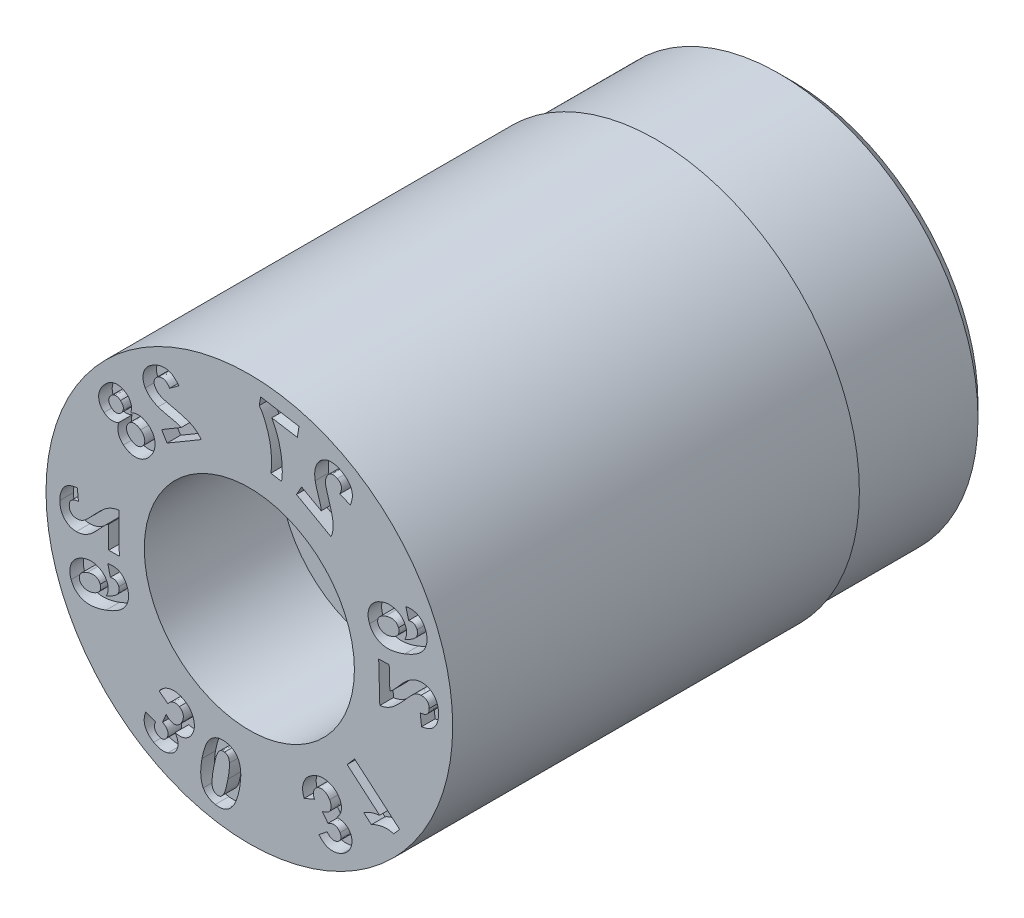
from build123d import *

# Parameters (mm, degrees)
SKETCH4_W          = 2
SKETCH4_H          = 1
CUT_EXTRUDE1_DEPTH = 0.2


with BuildPart() as part:
    # Sketch1 → Revolve1 (revolve)
    with BuildSketch(Plane(origin=(0, 0, 0), x_dir=(0, 0, -1), z_dir=(1, 0, 0)), mode=Mode.PRIVATE) as revolve1_sk:
        Polygon((0, 3), (0, 1.55), (2, 1.55), (2, 0.8), (8, 0.8), (8, 2.75), (7.75, 3), align=None)
    revolve(revolve1_sk.sketch.rotate(Axis((0, 0, 3.797909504), (0, 0, -1)), 90), axis=Axis((0, 0, 3.797909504), (0, 0, -1)))

    # Sketch4 → Cut-Revolve1 (revolve, cut)
    with BuildSketch(Plane(origin=(0, 0, 0), x_dir=(0, 0, -1), z_dir=(1, 0, 0)), mode=Mode.PRIVATE) as cut_revolve1_sk:
        with Locations((7, 3.435)):
            Rectangle(SKETCH4_W, SKETCH4_H)
    revolve(cut_revolve1_sk.sketch.rotate(Axis((0, 0, 0), (0, 0, -1)), 90), axis=Axis((0, 0, 0), (0, 0, -1)), mode=Mode.SUBTRACT)

    # Sketch6 → Cut-Extrude1 (cut)
    # profile 1 of 12: a face of its own
    with BuildSketch(Plane.XY):
        with BuildLine():
            Line((2.063311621, 0.319824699), (1.908061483, 0.315481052))
            Line((1.908061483, 0.315481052), (1.924665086, -0.270443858))
            add(Edge.make_bspline(
                [(1.924665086, -0.270443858), (1.939167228, -0.268028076), (1.968169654, -0.263196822), (2.010303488, -0.24956458), (2.051267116, -0.231791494), (2.084375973, -0.212777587), (2.111021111, -0.19417116), (2.132740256, -0.177332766), (2.155875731, -0.157421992), (2.180531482, -0.134642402), (2.206779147, -0.108869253), (2.234567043, -0.08022319), (2.263741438, -0.048501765), (2.283505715, -0.026262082), (2.29374756, -0.014737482)],
                knots=[0, 0, 0, 0, 1.149597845, 2.299048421, 3.455683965, 4.640909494, 5.280210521, 5.998919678, 6.791343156, 7.669002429, 8.626402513, 9.670792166, 10.793004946, 12, 12, 12, 12], degree=3))
            add(Edge.make_bspline(
                [(2.29374756, -0.014737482), (2.301844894, -0.005530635), (2.317324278, 0.012069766), (2.339882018, 0.036772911), (2.360156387, 0.058943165), (2.378469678, 0.078179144), (2.394882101, 0.09452601), (2.409082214, 0.108220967), (2.421123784, 0.119353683), (2.428936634, 0.125215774), (2.432408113, 0.127820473)],
                knots=[0, 0, 0, 0, 1.47776482, 2.824990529, 4.031919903, 5.09872173, 6.025857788, 6.823398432, 7.477201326, 8, 8, 8, 8], degree=3))
            add(Edge.make_bspline(
                [(2.432408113, 0.127820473), (2.440709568, 0.133387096), (2.456773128, 0.144158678), (2.482504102, 0.155648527), (2.508144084, 0.163234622), (2.525382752, 0.164601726), (2.533862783, 0.16527423)],
                knots=[0, 0, 0, 0, 1.09171233, 2.11249568, 3.071500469, 4, 4, 4, 4], degree=3))
            add(Edge.make_bspline(
                [(2.533862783, 0.16527423), (2.542662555, 0.165198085), (2.559414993, 0.165053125), (2.58310706, 0.160092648), (2.603764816, 0.151240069), (2.621145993, 0.138421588), (2.635027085, 0.122074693), (2.644982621, 0.102501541), (2.651374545, 0.080082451), (2.652516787, 0.064099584), (2.653114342, 0.055738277)],
                knots=[0, 0, 0, 0, 1.147018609, 2.183619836, 3.137700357, 4.06044057, 4.978414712, 5.912034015, 6.907697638, 8, 8, 8, 8], degree=3))
            add(Edge.make_bspline(
                [(2.653114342, 0.055738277), (2.652949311, 0.047407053), (2.652633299, 0.031453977), (2.647496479, 0.008559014), (2.637697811, -0.011499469), (2.626582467, -0.02627974), (2.615384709, -0.036243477), (2.6057935, -0.04321899), (2.594618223, -0.048994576), (2.582412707, -0.054498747), (2.568669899, -0.058725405), (2.553756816, -0.062522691), (2.537468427, -0.065386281), (2.526116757, -0.06658249), (2.520253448, -0.06720035)],
                knots=[0, 0, 0, 0, 1.466391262, 2.807924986, 4.095740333, 5.375284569, 6.036935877, 6.732024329, 7.459161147, 8.249549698, 9.088834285, 9.988616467, 10.961089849, 12, 12, 12, 12], degree=3))
            Line((2.520253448, -0.06720035), (2.541397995, -0.233117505))
            add(Edge.make_bspline(
                [(2.541397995, -0.233117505), (2.552470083, -0.231393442), (2.57397529, -0.228044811), (2.604770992, -0.220621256), (2.633018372, -0.211049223), (2.658893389, -0.199739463), (2.682275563, -0.186390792), (2.703149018, -0.17100675), (2.721506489, -0.153710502), (2.737224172, -0.134412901), (2.750742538, -0.113726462), (2.762300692, -0.091820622), (2.772107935, -0.068831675), (2.779835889, -0.044542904), (2.785766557, -0.019141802), (2.789723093, 0.007491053), (2.791680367, 0.035229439), (2.79154251, 0.054100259), (2.791472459, 0.06368944)],
                knots=[0, 0, 0, 0, 1.23811402, 2.404776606, 3.495838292, 4.530553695, 5.52114199, 6.46502987, 7.389983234, 8.300899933, 9.209104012, 10.116936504, 11.035001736, 11.967697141, 12.930300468, 13.914888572, 14.940453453, 16, 16, 16, 16], degree=3))
            add(Edge.make_bspline(
                [(2.791472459, 0.06368944), (2.790950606, 0.07414436), (2.789930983, 0.094571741), (2.78576754, 0.124260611), (2.779730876, 0.152222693), (2.77132173, 0.178384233), (2.760715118, 0.202749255), (2.748014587, 0.225340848), (2.733269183, 0.246170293), (2.716287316, 0.264829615), (2.697939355, 0.281569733), (2.678448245, 0.296120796), (2.657962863, 0.308333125), (2.636481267, 0.318159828), (2.614002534, 0.325771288), (2.590452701, 0.330524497), (2.565975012, 0.333541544), (2.549340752, 0.333493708), (2.540858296, 0.333469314)],
                knots=[0, 0, 0, 0, 1.213930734, 2.371842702, 3.473650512, 4.528987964, 5.554396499, 6.551402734, 7.530820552, 8.508409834, 9.472548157, 10.408386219, 11.325488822, 12.23401269, 13.144401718, 14.07195963, 15.016817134, 16, 16, 16, 16], degree=3))
            add(Edge.make_bspline(
                [(2.540858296, 0.333469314), (2.531163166, 0.332949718), (2.511934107, 0.331919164), (2.483530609, 0.326993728), (2.455909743, 0.319677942), (2.428858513, 0.309532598), (2.402118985, 0.296274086), (2.374994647, 0.280163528), (2.347169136, 0.261127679), (2.329126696, 0.24655051), (2.319798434, 0.239013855)],
                knots=[0, 0, 0, 0, 0.949328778, 1.882873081, 2.814609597, 3.741900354, 4.704577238, 5.731089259, 6.826932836, 8, 8, 8, 8], degree=3))
            add(Edge.make_bspline(
                [(2.319798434, 0.239013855), (2.316476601, 0.236148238), (2.30939982, 0.230043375), (2.2984698, 0.21982268), (2.286380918, 0.208198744), (2.273564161, 0.194682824), (2.259378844, 0.180015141), (2.244576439, 0.163424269), (2.228372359, 0.145635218), (2.211877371, 0.126542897), (2.19527149, 0.107875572), (2.180312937, 0.089977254), (2.165993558, 0.074679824), (2.153849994, 0.060617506), (2.142608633, 0.048940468), (2.133549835, 0.038460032), (2.125204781, 0.030571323), (2.113286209, 0.01848902), (2.096420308, 0.003741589), (2.080411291, -0.007038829), (2.072795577, -0.012167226)],
                knots=[0, 0, 0, 0, 0.670809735, 1.429082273, 2.28801005, 3.234931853, 4.277047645, 5.408111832, 6.634561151, 7.956720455, 9.266177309, 10.455187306, 11.522716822, 12.469638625, 13.295644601, 14.000955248, 14.586065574, 15.050291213, 16.596782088, 18, 18, 18, 18], degree=3))
            Line((2.072795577, -0.012167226), (2.063311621, 0.319824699))
        make_face()
    # profile 2 of 12: a face of its own
    with BuildSketch(Plane.XY):
        with BuildLine():
            Line((2.308567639, 1.185916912), (2.349580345, 1.028030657))
            add(Edge.make_bspline(
                [(2.349580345, 1.028030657), (2.357322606, 1.029668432), (2.371980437, 1.032769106), (2.39336368, 1.034332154), (2.412573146, 1.031742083), (2.429729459, 1.026148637), (2.4445068, 1.016993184), (2.457292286, 1.005226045), (2.4678432, 0.990496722), (2.47268357, 0.979172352), (2.475195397, 0.973295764)],
                knots=[0, 0, 0, 0, 1.244812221, 2.356707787, 3.353587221, 4.276822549, 5.17485029, 6.066380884, 6.99658134, 8, 8, 8, 8], degree=3))
            add(Edge.make_bspline(
                [(2.475195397, 0.973295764), (2.476630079, 0.969220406), (2.479485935, 0.96110806), (2.481657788, 0.94847274), (2.482566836, 0.935830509), (2.481747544, 0.923150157), (2.479197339, 0.910504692), (2.475441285, 0.897679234), (2.469761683, 0.884949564), (2.462634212, 0.871901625), (2.453001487, 0.858565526), (2.439750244, 0.845460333), (2.423598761, 0.831694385), (2.40408281, 0.817618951), (2.381140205, 0.803441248), (2.355057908, 0.788512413), (2.325518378, 0.773533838), (2.304592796, 0.763685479), (2.293674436, 0.758546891)],
                knots=[0, 0, 0, 0, 0.664746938, 1.323235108, 1.968134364, 2.614874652, 3.274109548, 3.952773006, 4.669972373, 5.417403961, 6.241484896, 7.194400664, 8.28137471, 9.51039444, 10.897864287, 12.435984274, 14.140400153, 16, 16, 16, 16], degree=3))
            add(Edge.make_bspline(
                [(2.293674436, 0.758546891), (2.297342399, 0.765564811), (2.304520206, 0.77929812), (2.312334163, 0.80079515), (2.317994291, 0.822209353), (2.321077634, 0.843746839), (2.321462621, 0.865391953), (2.319323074, 0.887099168), (2.314849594, 0.908914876), (2.309859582, 0.92304949), (2.307334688, 0.930201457)],
                knots=[0, 0, 0, 0, 1.06573862, 2.085534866, 3.073527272, 4.045533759, 5.008895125, 5.982608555, 6.979221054, 8, 8, 8, 8], degree=3))
            add(Edge.make_bspline(
                [(2.307334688, 0.930201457), (2.304075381, 0.938174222), (2.297650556, 0.953890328), (2.2849306, 0.975695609), (2.270751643, 0.99602064), (2.254213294, 1.01432288), (2.235731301, 1.030911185), (2.215295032, 1.045763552), (2.192777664, 1.058735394), (2.168652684, 1.069985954), (2.143169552, 1.078915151), (2.116950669, 1.08543646), (2.090181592, 1.088981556), (2.062935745, 1.089720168), (2.035158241, 1.088185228), (2.006838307, 1.083606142), (1.978014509, 1.076281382), (1.95900197, 1.069506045), (1.949302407, 1.066049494)],
                knots=[0, 0, 0, 0, 0.966418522, 1.905027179, 2.828568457, 3.746051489, 4.668861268, 5.613922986, 6.578288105, 7.583661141, 8.599831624, 9.606763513, 10.61337084, 11.626449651, 12.664507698, 13.733722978, 14.843821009, 16, 16, 16, 16], degree=3))
            add(Edge.make_bspline(
                [(1.949302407, 1.066049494), (1.939181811, 1.061921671), (1.919450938, 1.053874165), (1.891556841, 1.03942635), (1.866258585, 1.023065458), (1.843168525, 1.005145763), (1.822736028, 0.985361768), (1.804670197, 0.963856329), (1.788861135, 0.940785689), (1.775846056, 0.915978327), (1.765500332, 0.89021399), (1.757929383, 0.863849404), (1.753003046, 0.837143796), (1.751232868, 0.80994719), (1.752224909, 0.782362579), (1.75623911, 0.754429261), (1.762704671, 0.726037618), (1.769333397, 0.707464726), (1.77271543, 0.697988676)],
                knots=[0, 0, 0, 0, 1.142343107, 2.227084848, 3.278487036, 4.288269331, 5.278044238, 6.24589875, 7.220359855, 8.196098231, 9.168698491, 10.118147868, 11.059453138, 12.002200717, 12.961831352, 13.939868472, 14.948902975, 16, 16, 16, 16], degree=3))
            add(Edge.make_bspline(
                [(1.77271543, 0.697988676), (1.776870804, 0.687992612), (1.785020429, 0.668388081), (1.800818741, 0.641192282), (1.81865516, 0.616247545), (1.839350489, 0.594093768), (1.862451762, 0.57444352), (1.88807522, 0.557453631), (1.916053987, 0.542738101), (1.946591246, 0.530607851), (1.979977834, 0.521964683), (2.016158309, 0.516976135), (2.055204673, 0.516555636), (2.097057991, 0.519712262), (2.141756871, 0.52703398), (2.189383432, 0.537955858), (2.239754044, 0.553251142), (2.273900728, 0.565711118), (2.291575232, 0.572160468)],
                knots=[0, 0, 0, 0, 0.860749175, 1.68812279, 2.496915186, 3.29676106, 4.094416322, 4.905436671, 5.738540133, 6.606513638, 7.514488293, 8.476783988, 9.505890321, 10.616249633, 11.813586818, 13.107278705, 14.502712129, 16, 16, 16, 16], degree=3))
            add(Edge.make_bspline(
                [(2.291575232, 0.572160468), (2.309525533, 0.579337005), (2.344170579, 0.593188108), (2.393054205, 0.616099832), (2.437112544, 0.640130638), (2.476026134, 0.665627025), (2.510434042, 0.691803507), (2.539671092, 0.719386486), (2.564163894, 0.748034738), (2.583587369, 0.777893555), (2.598645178, 0.808474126), (2.610150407, 0.839339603), (2.617937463, 0.870661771), (2.621900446, 0.902373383), (2.622159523, 0.934464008), (2.618438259, 0.966835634), (2.61166332, 0.999669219), (2.604074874, 1.021044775), (2.60020642, 1.031941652)],
                knots=[0, 0, 0, 0, 1.480158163, 2.856784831, 4.131686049, 5.319849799, 6.416300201, 7.438114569, 8.392043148, 9.295822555, 10.15815633, 10.997513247, 11.813755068, 12.623971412, 13.43941903, 14.264861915, 15.115457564, 16, 16, 16, 16], degree=3))
            add(Edge.make_bspline(
                [(2.60020642, 1.031941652), (2.597158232, 1.039492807), (2.591201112, 1.054250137), (2.580299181, 1.075088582), (2.568275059, 1.094310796), (2.555108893, 1.112049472), (2.540514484, 1.127980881), (2.524755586, 1.142377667), (2.507784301, 1.155259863), (2.489532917, 1.166304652), (2.470219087, 1.175686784), (2.449849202, 1.183005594), (2.428520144, 1.18837614), (2.406289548, 1.192012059), (2.383090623, 1.193428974), (2.359027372, 1.192942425), (2.334019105, 1.190551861), (2.317198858, 1.187488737), (2.308567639, 1.185916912)],
                knots=[0, 0, 0, 0, 1.075048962, 2.100983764, 3.101352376, 4.067536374, 5.014450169, 5.950454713, 6.883526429, 7.823929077, 8.763658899, 9.715110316, 10.677327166, 11.665213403, 12.686056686, 13.742566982, 14.841610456, 16, 16, 16, 16], degree=3))
        make_face()
        with BuildLine():
            add(Edge.make_bspline(
                [(2.102560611, 0.70098228), (2.096354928, 0.69869014), (2.084304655, 0.694239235), (2.066193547, 0.68924545), (2.048791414, 0.685616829), (2.032018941, 0.683606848), (2.01590159, 0.683201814), (2.000463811, 0.684321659), (1.985576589, 0.686624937), (1.971548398, 0.690789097), (1.958595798, 0.696222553), (1.946454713, 0.701954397), (1.93582948, 0.709043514), (1.925980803, 0.716490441), (1.917709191, 0.725152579), (1.910230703, 0.734354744), (1.904225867, 0.744545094), (1.901095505, 0.751794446), (1.89953284, 0.755413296)],
                knots=[0, 0, 0, 0, 1.356902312, 2.63485035, 3.850774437, 5.001525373, 6.09614263, 7.153469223, 8.174065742, 9.181183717, 10.146436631, 11.055455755, 11.929996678, 12.762553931, 13.583240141, 14.3804746, 15.191538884, 16, 16, 16, 16], degree=3))
            add(Edge.make_bspline(
                [(1.89953284, 0.755413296), (1.897235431, 0.762520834), (1.892720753, 0.776487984), (1.892133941, 0.798576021), (1.896096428, 0.820376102), (1.903596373, 0.837975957), (1.912398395, 0.851372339), (1.92062095, 0.86148597), (1.930825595, 0.870938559), (1.942636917, 0.879998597), (1.955913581, 0.888897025), (1.971065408, 0.897086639), (1.987863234, 0.905081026), (1.999817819, 0.909838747), (2.006018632, 0.912306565)],
                knots=[0, 0, 0, 0, 1.25171898, 2.459775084, 3.672437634, 4.960019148, 5.646155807, 6.366508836, 7.148080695, 7.980969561, 8.870533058, 9.834961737, 10.877000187, 12, 12, 12, 12], degree=3))
            add(Edge.make_bspline(
                [(2.006018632, 0.912306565), (2.012487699, 0.914635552), (2.025016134, 0.919146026), (2.043470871, 0.924714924), (2.061053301, 0.928563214), (2.077667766, 0.930874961), (2.093333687, 0.932105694), (2.108019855, 0.931325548), (2.121770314, 0.929500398), (2.138363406, 0.924691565), (2.157157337, 0.916280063), (2.176197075, 0.90180869), (2.191612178, 0.883640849), (2.198004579, 0.869177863), (2.201269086, 0.861791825)],
                knots=[0, 0, 0, 0, 1.0897671, 2.110516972, 3.053236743, 3.939315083, 4.768492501, 5.539102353, 6.266568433, 6.961651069, 8.271520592, 9.504559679, 10.725614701, 12, 12, 12, 12], degree=3))
            add(Edge.make_bspline(
                [(2.201269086, 0.861791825), (2.203603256, 0.854348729), (2.208181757, 0.839749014), (2.209378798, 0.816599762), (2.204819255, 0.7937357), (2.197326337, 0.775155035), (2.188744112, 0.76085363), (2.180585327, 0.750606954), (2.171276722, 0.740654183), (2.160214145, 0.731681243), (2.147903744, 0.722973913), (2.134135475, 0.71493531), (2.11891483, 0.707464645), (2.10812567, 0.703188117), (2.102560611, 0.70098228)],
                knots=[0, 0, 0, 0, 1.320777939, 2.590720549, 3.885849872, 5.251283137, 5.970895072, 6.710697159, 7.471331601, 8.280047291, 9.124058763, 10.030017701, 10.983881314, 12, 12, 12, 12], degree=3))
        make_face(mode=Mode.SUBTRACT)
    # profile 3 of 12: a face of its own
    with BuildSketch(Plane.XY):
        with BuildLine():
            Line((0.770950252, 1.946069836), (0.695285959, 1.810883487))
            Line((0.695285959, 1.810883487), (1.205018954, 1.525386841))
            add(Edge.make_bspline(
                [(1.205018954, 1.525386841), (1.210358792, 1.539033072), (1.221034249, 1.566314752), (1.230956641, 1.609300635), (1.236661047, 1.653381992), (1.237442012, 1.691399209), (1.234995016, 1.723650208), (1.231822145, 1.750875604), (1.226451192, 1.780848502), (1.219807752, 1.813731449), (1.21103161, 1.849330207), (1.200642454, 1.887741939), (1.188844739, 1.929052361), (1.179804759, 1.957364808), (1.175122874, 1.972028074)],
                knots=[0, 0, 0, 0, 1.149474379, 2.298040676, 3.453280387, 4.636079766, 5.275905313, 5.992363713, 6.78756556, 7.666341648, 8.626565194, 9.666138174, 10.791272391, 12, 12, 12, 12], degree=3))
            add(Edge.make_bspline(
                [(1.175122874, 1.972028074), (1.171372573, 1.983667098), (1.164212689, 2.005887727), (1.154685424, 2.037819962), (1.146013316, 2.066504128), (1.138993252, 2.092103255), (1.133260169, 2.114528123), (1.128889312, 2.133776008), (1.12563994, 2.149823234), (1.124493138, 2.159540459), (1.123987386, 2.163825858)],
                knots=[0, 0, 0, 0, 1.476652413, 2.819149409, 4.024051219, 5.095266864, 6.024437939, 6.818810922, 7.4790832, 8, 8, 8, 8], degree=3))
            add(Edge.make_bspline(
                [(1.123987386, 2.163825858), (1.123524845, 2.173787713), (1.122632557, 2.193005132), (1.125896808, 2.220846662), (1.132430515, 2.246603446), (1.140120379, 2.261987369), (1.143897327, 2.269543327)],
                knots=[0, 0, 0, 0, 1.095280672, 2.112906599, 3.073136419, 4, 4, 4, 4], degree=3))
            add(Edge.make_bspline(
                [(1.143897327, 2.269543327), (1.148430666, 2.277082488), (1.157057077, 2.291428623), (1.173507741, 2.309171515), (1.19172482, 2.322234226), (1.211653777, 2.330448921), (1.232746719, 2.333940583), (1.254652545, 2.332693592), (1.277090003, 2.326600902), (1.291294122, 2.319345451), (1.298710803, 2.315557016)],
                knots=[0, 0, 0, 0, 1.148981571, 2.186376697, 3.14198494, 4.061156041, 4.98228758, 5.916647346, 6.912177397, 8, 8, 8, 8], degree=3))
            add(Edge.make_bspline(
                [(1.298710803, 2.315557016), (1.305790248, 2.311219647), (1.319399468, 2.302881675), (1.33617192, 2.286541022), (1.348693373, 2.268070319), (1.355346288, 2.250875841), (1.358383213, 2.236249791), (1.359032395, 2.224409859), (1.35867489, 2.211901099), (1.356701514, 2.198660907), (1.353419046, 2.184712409), (1.349020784, 2.169957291), (1.343130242, 2.154533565), (1.338289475, 2.144240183), (1.335785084, 2.138914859)],
                knots=[0, 0, 0, 0, 1.462368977, 2.8111953, 4.098813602, 5.374842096, 6.037906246, 6.729421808, 7.463233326, 8.244371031, 9.088117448, 9.991985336, 10.961145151, 12, 12, 12, 12], degree=3))
            Line((1.335785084, 2.138914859), (1.48887001, 2.072169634))
            add(Edge.make_bspline(
                [(1.48887001, 2.072169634), (1.493070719, 2.082508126), (1.501237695, 2.102608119), (1.510252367, 2.132906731), (1.516951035, 2.161971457), (1.52025988, 2.189936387), (1.520899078, 2.21674802), (1.51820035, 2.2423297), (1.512894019, 2.266861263), (1.504486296, 2.290164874), (1.493671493, 2.312368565), (1.480917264, 2.333556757), (1.465998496, 2.353587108), (1.449365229, 2.372746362), (1.430535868, 2.39067578), (1.40992625, 2.407705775), (1.387280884, 2.423703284), (1.37103194, 2.43318253), (1.362743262, 2.438017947)],
                knots=[0, 0, 0, 0, 1.236660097, 2.404302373, 3.500946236, 4.539864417, 5.521294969, 6.468386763, 7.38530318, 8.297694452, 9.207919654, 10.120101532, 11.035604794, 11.973915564, 12.929996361, 13.914881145, 14.936369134, 16, 16, 16, 16], degree=3))
            add(Edge.make_bspline(
                [(1.362743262, 2.438017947), (1.353533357, 2.44294256), (1.335549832, 2.452558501), (1.308045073, 2.46427681), (1.280946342, 2.473215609), (1.254356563, 2.479625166), (1.2280951, 2.482812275), (1.202328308, 2.483714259), (1.176931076, 2.4816788), (1.152275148, 2.476730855), (1.128546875, 2.469716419), (1.10624372, 2.460269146), (1.08520389, 2.449185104), (1.065754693, 2.435757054), (1.04791098, 2.420212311), (1.031607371, 2.402592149), (1.016575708, 2.383149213), (1.008095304, 2.368870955), (1.003797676, 2.361635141)],
                knots=[0, 0, 0, 0, 1.214941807, 2.372330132, 3.473764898, 4.532690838, 5.54935427, 6.546959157, 7.528617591, 8.506625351, 9.468629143, 10.402867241, 11.32079676, 12.231515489, 13.146587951, 14.068989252, 15.021418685, 16, 16, 16, 16], degree=3))
            add(Edge.make_bspline(
                [(1.003797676, 2.361635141), (0.999299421, 2.353051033), (0.990396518, 2.336061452), (0.979933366, 2.309324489), (0.972071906, 2.281937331), (0.96688685, 2.253568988), (0.964229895, 2.223882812), (0.964196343, 2.192408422), (0.966236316, 2.158899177), (0.969526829, 2.136040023), (0.971225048, 2.124242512)],
                knots=[0, 0, 0, 0, 0.950713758, 1.881643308, 2.812429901, 3.74360957, 4.707994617, 5.733907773, 6.830479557, 8, 8, 8, 8], degree=3))
            add(Edge.make_bspline(
                [(0.971225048, 2.124242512), (0.971977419, 2.119954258), (0.973593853, 2.110741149), (0.976550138, 2.096064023), (0.980759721, 2.079775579), (0.985263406, 2.06173541), (0.991030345, 2.042157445), (0.997171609, 2.020829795), (1.004545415, 1.997912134), (1.012199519, 1.973936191), (1.019933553, 1.950254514), (1.027062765, 1.928159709), (1.033504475, 1.908299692), (1.039045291, 1.890647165), (1.043485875, 1.875090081), (1.047440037, 1.861863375), (1.050267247, 1.850742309), (1.054238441, 1.834385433), (1.058129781, 1.812521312), (1.059206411, 1.793426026), (1.059720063, 1.784315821)],
                knots=[0, 0, 0, 0, 0.667728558, 1.434583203, 2.295297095, 3.247401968, 4.285995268, 5.424951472, 6.651125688, 7.977858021, 9.284948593, 10.471812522, 11.538451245, 12.487052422, 13.309059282, 14.019624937, 14.604006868, 15.068532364, 16.601420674, 18, 18, 18, 18], degree=3))
            Line((1.059720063, 1.784315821), (0.770950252, 1.946069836))
        make_face()
    # profile 4 of 12: a face of its own
    with BuildSketch(Plane.XY):
        with BuildLine():
            Line((0.707752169, 2.546242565), (0.733139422, 2.700107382))
            Line((0.733139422, 2.700107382), (0.166926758, 2.793759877))
            Line((0.166926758, 2.793759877), (0.146974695, 2.673598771))
            add(Edge.make_bspline(
                [(0.146974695, 2.673598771), (0.151926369, 2.666604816), (0.162065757, 2.65228351), (0.176254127, 2.629208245), (0.190388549, 2.604382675), (0.204138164, 2.577549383), (0.217741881, 2.54885008), (0.231263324, 2.518332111), (0.244136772, 2.48572627), (0.261534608, 2.44008652), (0.280825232, 2.380964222), (0.299515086, 2.308353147), (0.313501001, 2.234364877), (0.321222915, 2.172044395), (0.325192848, 2.122443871), (0.327274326, 2.086303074), (0.327927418, 2.051365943), (0.328124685, 2.017547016), (0.326625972, 1.98494595), (0.324392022, 1.953447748), (0.321391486, 1.923052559), (0.318153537, 1.903288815), (0.316561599, 1.893571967)],
                knots=[0, 0, 0, 0, 0.630513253, 1.291082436, 1.992460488, 2.732564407, 3.509357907, 4.329686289, 5.188526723, 6.088858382, 7.924167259, 9.761736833, 11.603179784, 13.461887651, 14.380071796, 15.265015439, 16.125498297, 16.951483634, 17.753413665, 18.526442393, 19.275525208, 20, 20, 20, 20], degree=3))
            Line((0.316561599, 1.893571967), (0.476276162, 1.867324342))
            add(Edge.make_bspline(
                [(0.476276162, 1.867324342), (0.478233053, 1.882389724), (0.482160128, 1.912622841), (0.485388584, 1.958498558), (0.486784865, 2.004912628), (0.486079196, 2.051901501), (0.483241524, 2.099363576), (0.478662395, 2.147418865), (0.471731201, 2.195975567), (0.463087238, 2.244927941), (0.452518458, 2.29361139), (0.440261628, 2.341624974), (0.426079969, 2.388552), (0.410697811, 2.434666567), (0.393179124, 2.47956922), (0.37438923, 2.523653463), (0.353865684, 2.566727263), (0.33872186, 2.594640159), (0.331168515, 2.608562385)],
                knots=[0, 0, 0, 0, 0.949444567, 1.905339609, 2.87318468, 3.851352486, 4.841712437, 5.844553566, 6.867908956, 7.906794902, 8.951198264, 9.981176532, 11.003371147, 12.014952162, 13.019003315, 14.015230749, 15.010048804, 16, 16, 16, 16], degree=3))
            Line((0.331168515, 2.608562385), (0.707752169, 2.546242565))
        make_face()
    # profile 5 of 12: a face of its own
    with BuildSketch(Plane.XY):
        with BuildLine():
            Line((-1.293531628, 1.646481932), (-1.214767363, 1.512663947))
            Line((-1.214767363, 1.512663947), (-0.709860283, 1.809692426))
            add(Edge.make_bspline(
                [(-0.709860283, 1.809692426), (-0.719002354, 1.821195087), (-0.737261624, 1.844169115), (-0.769487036, 1.874492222), (-0.804876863, 1.901634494), (-0.837402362, 1.921606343), (-0.866387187, 1.936105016), (-0.891696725, 1.946711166), (-0.920218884, 1.957499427), (-0.95212013, 1.968110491), (-0.987402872, 1.978463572), (-1.025890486, 1.98892324), (-1.067670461, 1.999449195), (-1.09672388, 2.005945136), (-1.111769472, 2.009309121)],
                knots=[0, 0, 0, 0, 1.1497544, 2.296380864, 3.455139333, 4.639220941, 5.279648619, 5.992342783, 6.78784171, 7.668094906, 8.625209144, 9.667952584, 10.792326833, 12, 12, 12, 12], degree=3))
            add(Edge.make_bspline(
                [(-1.111769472, 2.009309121), (-1.123787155, 2.011973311), (-1.146648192, 2.017041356), (-1.179126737, 2.024805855), (-1.208245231, 2.031995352), (-1.233889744, 2.038878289), (-1.256237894, 2.045001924), (-1.275024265, 2.051057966), (-1.290509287, 2.056443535), (-1.299499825, 2.060331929), (-1.303461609, 2.062045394)],
                knots=[0, 0, 0, 0, 1.484095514, 2.82317009, 4.026143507, 5.1000705, 6.024583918, 6.819329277, 7.479723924, 8, 8, 8, 8], degree=3))
            add(Edge.make_bspline(
                [(-1.303461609, 2.062045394), (-1.31225524, 2.066688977), (-1.329290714, 2.075684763), (-1.351808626, 2.092476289), (-1.370840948, 2.111241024), (-1.380283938, 2.125724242), (-1.384931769, 2.132852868)],
                knots=[0, 0, 0, 0, 1.088756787, 2.109195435, 3.069347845, 4, 4, 4, 4], degree=3))
            add(Edge.make_bspline(
                [(-1.384931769, 2.132852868), (-1.389084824, 2.140607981), (-1.396970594, 2.155333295), (-1.404340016, 2.17841571), (-1.406355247, 2.200827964), (-1.403343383, 2.222221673), (-1.395730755, 2.242183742), (-1.383616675, 2.260464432), (-1.367055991, 2.276926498), (-1.353531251, 2.28559034), (-1.346456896, 2.290122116)],
                knots=[0, 0, 0, 0, 1.147311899, 2.178501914, 3.140501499, 4.061119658, 4.975963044, 5.907043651, 6.905242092, 8, 8, 8, 8], degree=3))
            add(Edge.make_bspline(
                [(-1.346456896, 2.290122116), (-1.339119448, 2.294081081), (-1.325034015, 2.301680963), (-1.302416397, 2.307786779), (-1.280164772, 2.309441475), (-1.2619456, 2.306476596), (-1.24777135, 2.301620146), (-1.237212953, 2.296242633), (-1.226599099, 2.28956207), (-1.216101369, 2.281241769), (-1.205613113, 2.271351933), (-1.195283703, 2.259854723), (-1.184776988, 2.247024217), (-1.178233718, 2.237654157), (-1.174846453, 2.232803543)],
                knots=[0, 0, 0, 0, 1.464510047, 2.811366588, 4.091954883, 5.368982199, 6.030976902, 6.725205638, 7.45097528, 8.237193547, 9.080741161, 9.987465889, 10.958168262, 12, 12, 12, 12], degree=3))
            Line((-1.174846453, 2.232803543), (-1.039840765, 2.331875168))
            add(Edge.make_bspline(
                [(-1.039840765, 2.331875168), (-1.046666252, 2.340756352), (-1.059903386, 2.357980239), (-1.081421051, 2.381209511), (-1.103371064, 2.401412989), (-1.125900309, 2.418387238), (-1.148802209, 2.432368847), (-1.172115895, 2.443467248), (-1.196134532, 2.451020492), (-1.220527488, 2.455615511), (-1.245200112, 2.457438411), (-1.26996799, 2.457132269), (-1.294885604, 2.454360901), (-1.319885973, 2.449602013), (-1.344942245, 2.442296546), (-1.370126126, 2.433049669), (-1.395364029, 2.421412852), (-1.411752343, 2.412116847), (-1.420092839, 2.407385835)],
                knots=[0, 0, 0, 0, 1.238732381, 2.402358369, 3.498289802, 4.535390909, 5.517848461, 6.462763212, 7.384583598, 8.295333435, 9.203015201, 10.117447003, 11.031925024, 11.973366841, 12.929553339, 13.916067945, 14.939425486, 16, 16, 16, 16], degree=3))
            add(Edge.make_bspline(
                [(-1.420092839, 2.407385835), (-1.429018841, 2.401867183), (-1.446402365, 2.391119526), (-1.470474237, 2.373304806), (-1.491998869, 2.354458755), (-1.510700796, 2.334420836), (-1.527107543, 2.313583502), (-1.540730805, 2.291592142), (-1.551671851, 2.268538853), (-1.560061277, 2.244742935), (-1.565712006, 2.220605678), (-1.569293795, 2.196541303), (-1.569934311, 2.172697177), (-1.568152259, 2.149094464), (-1.563993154, 2.125733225), (-1.557055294, 2.102731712), (-1.547714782, 2.079935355), (-1.53966518, 2.06539991), (-1.535548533, 2.057966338)],
                knots=[0, 0, 0, 0, 1.21770937, 2.371507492, 3.47172616, 4.533755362, 5.548588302, 6.545546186, 7.529635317, 8.505178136, 9.468314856, 10.403141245, 11.324407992, 12.230553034, 13.146680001, 14.072731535, 15.014375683, 16, 16, 16, 16], degree=3))
            add(Edge.make_bspline(
                [(-1.535548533, 2.057966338), (-1.530397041, 2.049740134), (-1.520208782, 2.033470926), (-1.502234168, 2.011003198), (-1.482581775, 1.990315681), (-1.46051934, 1.971694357), (-1.436265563, 1.954296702), (-1.409019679, 1.938391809), (-1.378950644, 1.923266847), (-1.357569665, 1.914481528), (-1.346527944, 1.909944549)],
                knots=[0, 0, 0, 0, 0.950449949, 1.879733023, 2.814068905, 3.742334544, 4.704434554, 5.735552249, 6.830577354, 8, 8, 8, 8], degree=3))
            add(Edge.make_bspline(
                [(-1.346527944, 1.909944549), (-1.342424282, 1.908366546), (-1.333630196, 1.904984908), (-1.31933934, 1.900328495), (-1.303197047, 1.895730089), (-1.285306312, 1.890587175), (-1.265507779, 1.885438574), (-1.243794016, 1.880302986), (-1.220294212, 1.87494859), (-1.195689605, 1.869537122), (-1.171282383, 1.864280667), (-1.148516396, 1.859339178), (-1.12811579, 1.854625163), (-1.110007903, 1.850461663), (-1.094211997, 1.846755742), (-1.080775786, 1.843368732), (-1.069711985, 1.84026655), (-1.053519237, 1.835399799), (-1.03262118, 1.827650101), (-1.015563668, 1.818902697), (-1.007443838, 1.814738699)],
                knots=[0, 0, 0, 0, 0.672367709, 1.44087375, 2.297736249, 3.239474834, 4.287950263, 5.426183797, 6.65205271, 7.974285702, 9.279302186, 10.470687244, 11.53730208, 12.481695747, 13.312522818, 14.018812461, 14.600839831, 15.069732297, 16.605114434, 18, 18, 18, 18], degree=3))
            Line((-1.007443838, 1.814738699), (-1.293531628, 1.646481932))
        make_face()
    # profile 6 of 12: a face of its own
    with BuildSketch(Plane.XY):
        with BuildLine():
            add(Edge.make_bspline(
                [(-1.750101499, 1.632648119), (-1.747201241, 1.643486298), (-1.74160579, 1.664396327), (-1.738521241, 1.695784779), (-1.74015087, 1.72547374), (-1.746940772, 1.753205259), (-1.757959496, 1.778675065), (-1.771776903, 1.802377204), (-1.789067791, 1.823967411), (-1.802845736, 1.836297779), (-1.809817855, 1.842537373)],
                knots=[0, 0, 0, 0, 1.156321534, 2.230883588, 3.239532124, 4.211000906, 5.160144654, 6.094272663, 7.035635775, 8, 8, 8, 8], degree=3))
            add(Edge.make_bspline(
                [(-1.809817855, 1.842537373), (-1.816020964, 1.847445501), (-1.828228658, 1.857104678), (-1.847843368, 1.869230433), (-1.86813698, 1.878829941), (-1.888786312, 1.886508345), (-1.910057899, 1.891727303), (-1.931861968, 1.894277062), (-1.954192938, 1.89500681), (-1.976945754, 1.893130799), (-1.999831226, 1.888805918), (-2.022446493, 1.8817699), (-2.044651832, 1.872075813), (-2.066436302, 1.859741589), (-2.087938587, 1.844884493), (-2.108723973, 1.827038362), (-2.129526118, 1.806980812), (-2.14237832, 1.791955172), (-2.148998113, 1.784215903)],
                knots=[0, 0, 0, 0, 0.977882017, 1.924468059, 2.844706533, 3.750945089, 4.645448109, 5.546512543, 6.461829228, 7.404976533, 8.364423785, 9.337268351, 10.328271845, 11.355710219, 12.429512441, 13.555573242, 14.740947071, 16, 16, 16, 16], degree=3))
            add(Edge.make_bspline(
                [(-2.148998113, 1.784215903), (-2.155259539, 1.776372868), (-2.167485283, 1.761058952), (-2.183411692, 1.737247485), (-2.19654137, 1.71342653), (-2.207332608, 1.689827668), (-2.215171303, 1.666135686), (-2.220804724, 1.642574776), (-2.22322262, 1.618975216), (-2.223319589, 1.59562689), (-2.220872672, 1.572812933), (-2.216466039, 1.550782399), (-2.209420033, 1.529845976), (-2.200721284, 1.509713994), (-2.189401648, 1.490736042), (-2.176032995, 1.472740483), (-2.160558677, 1.455625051), (-2.148829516, 1.445351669), (-2.142858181, 1.440121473)],
                knots=[0, 0, 0, 0, 1.242435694, 2.425917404, 3.542073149, 4.607949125, 5.63419089, 6.627928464, 7.601615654, 8.564915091, 9.514261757, 10.43851261, 11.341082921, 12.244825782, 13.149388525, 14.070425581, 15.017650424, 16, 16, 16, 16], degree=3))
            add(Edge.make_bspline(
                [(-2.142858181, 1.440121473), (-2.135044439, 1.434097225), (-2.119733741, 1.422292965), (-2.094205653, 1.409000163), (-2.067496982, 1.400028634), (-2.039837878, 1.394937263), (-2.011608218, 1.394267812), (-1.983313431, 1.397663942), (-1.955047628, 1.405331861), (-1.937132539, 1.413632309), (-1.927947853, 1.417887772)],
                knots=[0, 0, 0, 0, 1.030773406, 2.01975698, 2.99434141, 3.96941053, 4.951028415, 5.937045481, 6.942366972, 8, 8, 8, 8], degree=3))
            add(Edge.make_bspline(
                [(-1.927947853, 1.417887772), (-1.931389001, 1.405779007), (-1.938072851, 1.382259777), (-1.941580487, 1.346501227), (-1.940309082, 1.312013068), (-1.934613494, 1.284283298), (-1.927315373, 1.263120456), (-1.921128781, 1.247613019), (-1.913297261, 1.232841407), (-1.904576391, 1.218560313), (-1.894470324, 1.204955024), (-1.883459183, 1.191758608), (-1.870905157, 1.179440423), (-1.862010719, 1.171642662), (-1.857503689, 1.167691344)],
                knots=[0, 0, 0, 0, 1.631795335, 3.169486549, 4.642433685, 6.099983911, 6.824050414, 7.548317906, 8.265273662, 8.992229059, 9.719184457, 10.464019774, 11.221680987, 12, 12, 12, 12], degree=3))
            add(Edge.make_bspline(
                [(-1.857503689, 1.167691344), (-1.849771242, 1.161634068), (-1.834607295, 1.149755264), (-1.810691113, 1.134514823), (-1.786244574, 1.122148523), (-1.761406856, 1.112456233), (-1.736043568, 1.105496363), (-1.710223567, 1.101433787), (-1.683983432, 1.100109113), (-1.657567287, 1.101629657), (-1.631258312, 1.105608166), (-1.605627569, 1.112781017), (-1.580732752, 1.122332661), (-1.556654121, 1.134693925), (-1.533547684, 1.150053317), (-1.510942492, 1.167796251), (-1.489381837, 1.188502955), (-1.476078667, 1.203839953), (-1.469292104, 1.211664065)],
                knots=[0, 0, 0, 0, 1.071186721, 2.100682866, 3.088018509, 4.055677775, 5.004682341, 5.951671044, 6.901692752, 7.865458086, 8.834008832, 9.798690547, 10.763137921, 11.738854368, 12.744848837, 13.785699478, 14.870382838, 16, 16, 16, 16], degree=3))
            add(Edge.make_bspline(
                [(-1.469292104, 1.211664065), (-1.463279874, 1.219225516), (-1.451473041, 1.234074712), (-1.435923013, 1.257423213), (-1.422683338, 1.281074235), (-1.411648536, 1.304961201), (-1.403108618, 1.329149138), (-1.396762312, 1.353637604), (-1.392558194, 1.378432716), (-1.391739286, 1.395132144), (-1.391331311, 1.403451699)],
                knots=[0, 0, 0, 0, 1.098391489, 2.157023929, 3.186456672, 4.178592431, 5.146042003, 6.099727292, 7.053295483, 8, 8, 8, 8], degree=3))
            add(Edge.make_bspline(
                [(-1.391331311, 1.403451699), (-1.391389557, 1.41316018), (-1.391504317, 1.432288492), (-1.395702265, 1.460439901), (-1.403028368, 1.487390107), (-1.413275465, 1.51333819), (-1.427157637, 1.537890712), (-1.443835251, 1.561478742), (-1.464064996, 1.583608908), (-1.479314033, 1.597065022), (-1.487124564, 1.603957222)],
                knots=[0, 0, 0, 0, 1.009958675, 1.989889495, 2.953329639, 3.913324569, 4.886584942, 5.883165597, 6.915761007, 8, 8, 8, 8], degree=3))
            add(Edge.make_bspline(
                [(-1.487124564, 1.603957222), (-1.496315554, 1.610984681), (-1.514440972, 1.624843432), (-1.544504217, 1.641038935), (-1.576195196, 1.65283626), (-1.60378484, 1.659166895), (-1.626369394, 1.661901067), (-1.643629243, 1.662096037), (-1.661075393, 1.661218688), (-1.678717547, 1.658553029), (-1.696402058, 1.65415581), (-1.714327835, 1.648666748), (-1.73231677, 1.64143792), (-1.744107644, 1.63561048), (-1.750101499, 1.632648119)],
                knots=[0, 0, 0, 0, 1.477085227, 2.912938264, 4.345349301, 5.788257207, 6.519950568, 7.249133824, 7.991656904, 8.750859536, 9.5254004, 10.319185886, 11.145563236, 12, 12, 12, 12], degree=3))
        make_face()
        with BuildLine():
            add(Edge.make_bspline(
                [(-1.901309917, 1.713313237), (-1.895381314, 1.708093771), (-1.88403088, 1.698100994), (-1.87128161, 1.680293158), (-1.86246437, 1.661683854), (-1.858693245, 1.642072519), (-1.859023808, 1.622221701), (-1.863858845, 1.602690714), (-1.87261909, 1.583554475), (-1.881328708, 1.572160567), (-1.885858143, 1.566235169)],
                knots=[0, 0, 0, 0, 1.13037971, 2.164135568, 3.11936379, 4.063959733, 5.003459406, 5.947113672, 6.932397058, 8, 8, 8, 8], degree=3))
            add(Edge.make_bspline(
                [(-1.885858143, 1.566235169), (-1.890899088, 1.560587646), (-1.900558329, 1.549766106), (-1.917923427, 1.537570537), (-1.93628772, 1.529132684), (-1.955802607, 1.525114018), (-1.97589434, 1.525236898), (-1.99598213, 1.530092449), (-2.015776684, 1.539645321), (-2.027737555, 1.548814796), (-2.034016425, 1.553628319)],
                knots=[0, 0, 0, 0, 1.077854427, 2.065337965, 3.005597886, 3.945520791, 4.88679104, 5.852064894, 6.872439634, 8, 8, 8, 8], degree=3))
            add(Edge.make_bspline(
                [(-2.034016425, 1.553628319), (-2.039583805, 1.558632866), (-2.050267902, 1.568236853), (-2.062472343, 1.585416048), (-2.070905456, 1.603679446), (-2.074659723, 1.623137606), (-2.074458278, 1.642840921), (-2.070169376, 1.662414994), (-2.061144, 1.681294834), (-2.052612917, 1.692690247), (-2.048173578, 1.698620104)],
                knots=[0, 0, 0, 0, 1.091750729, 2.095127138, 3.057952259, 4.011725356, 4.967161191, 5.92163067, 6.918474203, 8, 8, 8, 8], degree=3))
            add(Edge.make_bspline(
                [(-2.048173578, 1.698620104), (-2.043083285, 1.70432993), (-2.033327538, 1.715273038), (-2.015828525, 1.727771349), (-1.997155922, 1.736164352), (-1.977497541, 1.740242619), (-1.957504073, 1.740187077), (-1.937909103, 1.735219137), (-1.918652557, 1.72661739), (-1.907230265, 1.717854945), (-1.901309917, 1.713313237)],
                knots=[0, 0, 0, 0, 1.100202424, 2.108581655, 3.074526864, 4.032111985, 4.982586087, 5.930640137, 6.927419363, 8, 8, 8, 8], degree=3))
        make_face(mode=Mode.SUBTRACT)
        with BuildLine():
            add(Edge.make_bspline(
                [(-1.604360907, 1.487415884), (-1.600131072, 1.483786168), (-1.591879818, 1.476705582), (-1.580752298, 1.465300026), (-1.570883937, 1.453757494), (-1.562774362, 1.441745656), (-1.555656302, 1.429806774), (-1.550212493, 1.417466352), (-1.546463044, 1.404806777), (-1.543757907, 1.392094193), (-1.542666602, 1.379323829), (-1.542675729, 1.366836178), (-1.544314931, 1.354689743), (-1.546775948, 1.342876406), (-1.550886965, 1.331410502), (-1.55596933, 1.320197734), (-1.562765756, 1.309536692), (-1.567896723, 1.302781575), (-1.570512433, 1.299337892)],
                knots=[0, 0, 0, 0, 1.244542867, 2.427763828, 3.556122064, 4.631707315, 5.661292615, 6.657968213, 7.635000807, 8.606462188, 9.556037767, 10.49310096, 11.38975836, 12.2894852, 13.183351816, 14.105026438, 15.033963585, 16, 16, 16, 16], degree=3))
            add(Edge.make_bspline(
                [(-1.570512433, 1.299337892), (-1.576161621, 1.293227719), (-1.587139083, 1.281354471), (-1.60740597, 1.26816062), (-1.629722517, 1.259664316), (-1.649756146, 1.2569291), (-1.666319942, 1.256935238), (-1.67909438, 1.258845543), (-1.69207672, 1.2616024), (-1.705093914, 1.266345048), (-1.718227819, 1.272386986), (-1.731384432, 1.280119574), (-1.744790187, 1.288992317), (-1.753427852, 1.295844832), (-1.757864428, 1.299364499)],
                knots=[0, 0, 0, 0, 1.415140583, 2.749891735, 4.083136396, 5.457756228, 6.173340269, 6.902417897, 7.656628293, 8.4337395, 9.259923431, 10.119954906, 11.0343496, 12, 12, 12, 12], degree=3))
            add(Edge.make_bspline(
                [(-1.757864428, 1.299364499), (-1.765072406, 1.305882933), (-1.778920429, 1.318406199), (-1.795210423, 1.340340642), (-1.806415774, 1.363765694), (-1.811075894, 1.384381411), (-1.812607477, 1.400834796), (-1.812395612, 1.412973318), (-1.810880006, 1.424827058), (-1.807988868, 1.436346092), (-1.80397087, 1.44764156), (-1.798761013, 1.458686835), (-1.792087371, 1.469318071), (-1.786888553, 1.475974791), (-1.784250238, 1.479352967)],
                knots=[0, 0, 0, 0, 1.711487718, 3.288123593, 4.786849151, 6.260403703, 6.989775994, 7.699427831, 8.397780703, 9.093666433, 9.790709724, 10.510289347, 11.2439964, 12, 12, 12, 12], degree=3))
            add(Edge.make_bspline(
                [(-1.784250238, 1.479352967), (-1.781021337, 1.483107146), (-1.774780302, 1.490363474), (-1.764382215, 1.499763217), (-1.753618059, 1.507620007), (-1.742433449, 1.513956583), (-1.730788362, 1.518498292), (-1.71882149, 1.521518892), (-1.706429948, 1.52296006), (-1.689620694, 1.522759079), (-1.669027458, 1.519523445), (-1.645560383, 1.512520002), (-1.623677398, 1.501968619), (-1.610845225, 1.492301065), (-1.604360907, 1.487415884)],
                knots=[0, 0, 0, 0, 0.881597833, 1.704010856, 2.490865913, 3.25237525, 3.987516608, 4.711160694, 5.445929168, 6.203614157, 7.700277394, 9.142709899, 10.556162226, 12, 12, 12, 12], degree=3))
        make_face(mode=Mode.SUBTRACT)
    # profile 7 of 12: a face of its own
    with BuildSketch(Plane.XY):
        with BuildLine():
            Line((-2.074481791, -0.285860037), (-1.919176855, -0.285485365))
            Line((-1.919176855, -0.285485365), (-1.920647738, 0.300653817))
            add(Edge.make_bspline(
                [(-1.920647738, 0.300653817), (-1.935211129, 0.298542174), (-1.964261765, 0.294329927), (-2.006850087, 0.282182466), (-2.048105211, 0.26523125), (-2.081740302, 0.247236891), (-2.108942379, 0.229643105), (-2.130886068, 0.213069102), (-2.154498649, 0.193725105), (-2.179741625, 0.171498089), (-2.206540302, 0.146377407), (-2.23515049, 0.118618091), (-2.265104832, 0.087625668), (-2.285403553, 0.065811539), (-2.295936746, 0.054491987)],
                knots=[0, 0, 0, 0, 1.151343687, 2.296667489, 3.457014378, 4.638490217, 5.277963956, 5.99212472, 6.790511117, 7.667925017, 8.625296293, 9.666649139, 10.789202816, 12, 12, 12, 12], degree=3))
            add(Edge.make_bspline(
                [(-2.295936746, 0.054491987), (-2.304333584, 0.045499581), (-2.320359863, 0.028336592), (-2.34341668, 0.004037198), (-2.364447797, -0.017358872), (-2.383215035, -0.036150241), (-2.40004856, -0.051991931), (-2.414520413, -0.065473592), (-2.427108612, -0.075953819), (-2.434975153, -0.081790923), (-2.438448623, -0.084368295)],
                knots=[0, 0, 0, 0, 1.482212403, 2.828963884, 4.035335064, 5.096579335, 6.028113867, 6.82001916, 7.478979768, 8, 8, 8, 8], degree=3))
            add(Edge.make_bspline(
                [(-2.438448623, -0.084368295), (-2.446929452, -0.089651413), (-2.463313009, -0.099857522), (-2.489240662, -0.110828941), (-2.515063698, -0.117739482), (-2.53234673, -0.118694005), (-2.540844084, -0.119163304)],
                knots=[0, 0, 0, 0, 1.092107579, 2.109770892, 3.070652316, 4, 4, 4, 4], degree=3))
            add(Edge.make_bspline(
                [(-2.540844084, -0.119163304), (-2.54963929, -0.118890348), (-2.566387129, -0.118370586), (-2.589939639, -0.112570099), (-2.61041226, -0.103184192), (-2.627434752, -0.089777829), (-2.640709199, -0.072994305), (-2.650341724, -0.053292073), (-2.656202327, -0.030717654), (-2.656820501, -0.014689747), (-2.657143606, -0.006312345)],
                knots=[0, 0, 0, 0, 1.145771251, 2.181778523, 3.142226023, 4.064437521, 4.981885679, 5.911370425, 6.90832351, 8, 8, 8, 8], degree=3))
            add(Edge.make_bspline(
                [(-2.657143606, -0.006312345), (-2.656806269, 0.002017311), (-2.656160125, 0.017972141), (-2.650086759, 0.040595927), (-2.640297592, 0.060654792), (-2.628572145, 0.074993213), (-2.617100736, 0.084637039), (-2.607231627, 0.091241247), (-2.596032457, 0.096993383), (-2.583479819, 0.101716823), (-2.569740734, 0.105888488), (-2.554664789, 0.109122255), (-2.53829588, 0.11145533), (-2.526918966, 0.112436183), (-2.521040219, 0.112943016)],
                knots=[0, 0, 0, 0, 1.465057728, 2.806207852, 4.093363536, 5.372541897, 6.034004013, 6.72889371, 7.460452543, 8.24687586, 9.088789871, 9.988314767, 10.960510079, 12, 12, 12, 12], degree=3))
            Line((-2.521040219, 0.112943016), (-2.538050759, 0.27943341))
            add(Edge.make_bspline(
                [(-2.538050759, 0.27943341), (-2.549173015, 0.278002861), (-2.570723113, 0.275231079), (-2.601665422, 0.268545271), (-2.63014849, 0.259719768), (-2.656274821, 0.249044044), (-2.680047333, 0.236401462), (-2.70125171, 0.221570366), (-2.720005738, 0.204744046), (-2.736422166, 0.186061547), (-2.750212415, 0.165536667), (-2.762639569, 0.144068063), (-2.772878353, 0.121182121), (-2.781130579, 0.097086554), (-2.787812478, 0.071855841), (-2.792248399, 0.04538677), (-2.795253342, 0.017698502), (-2.795533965, -0.001173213), (-2.795677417, -0.010820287)],
                knots=[0, 0, 0, 0, 1.239068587, 2.400776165, 3.493787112, 4.530997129, 5.515910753, 6.463543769, 7.383692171, 8.294672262, 9.204517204, 10.112412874, 11.033706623, 11.970393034, 12.925099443, 13.914968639, 14.934148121, 16, 16, 16, 16], degree=3))
            add(Edge.make_bspline(
                [(-2.795677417, -0.010820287), (-2.795424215, -0.021287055), (-2.794929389, -0.041741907), (-2.791515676, -0.071544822), (-2.786185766, -0.09968492), (-2.778411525, -0.126012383), (-2.768565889, -0.15058753), (-2.756623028, -0.173467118), (-2.742226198, -0.194442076), (-2.726017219, -0.213762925), (-2.707861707, -0.230713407), (-2.688966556, -0.246067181), (-2.66860094, -0.258517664), (-2.64749016, -0.269230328), (-2.625075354, -0.277159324), (-2.60169302, -0.282748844), (-2.577315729, -0.286555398), (-2.560685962, -0.286884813), (-2.552207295, -0.287052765)],
                knots=[0, 0, 0, 0, 1.214473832, 2.373405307, 3.476758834, 4.534255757, 5.553601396, 6.544824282, 7.522609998, 8.500467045, 9.465014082, 10.401108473, 11.320538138, 12.229310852, 13.143974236, 14.071786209, 15.016902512, 16, 16, 16, 16], degree=3))
            add(Edge.make_bspline(
                [(-2.552207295, -0.287052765), (-2.542500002, -0.286776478), (-2.523241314, -0.28622834), (-2.494754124, -0.282037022), (-2.466983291, -0.275373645), (-2.439733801, -0.265875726), (-2.412503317, -0.253543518), (-2.384951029, -0.238043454), (-2.356556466, -0.219783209), (-2.338159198, -0.205622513), (-2.328665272, -0.198314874)],
                knots=[0, 0, 0, 0, 0.949185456, 1.883127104, 2.810199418, 3.738962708, 4.701264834, 5.730126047, 6.828629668, 8, 8, 8, 8], degree=3))
            add(Edge.make_bspline(
                [(-2.328665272, -0.198314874), (-2.325249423, -0.195561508), (-2.317942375, -0.189671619), (-2.306817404, -0.179667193), (-2.294483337, -0.168315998), (-2.28117963, -0.155341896), (-2.266872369, -0.140795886), (-2.251399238, -0.124830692), (-2.234941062, -0.107269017), (-2.217938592, -0.088619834), (-2.201156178, -0.070106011), (-2.185138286, -0.053210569), (-2.170957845, -0.037848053), (-2.158191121, -0.024350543), (-2.146777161, -0.012787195), (-2.137225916, -0.002713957), (-2.128942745, 0.005226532), (-2.116566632, 0.016836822), (-2.09932625, 0.031053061), (-2.083068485, 0.041364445), (-2.075356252, 0.04625588)],
                knots=[0, 0, 0, 0, 0.671094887, 1.43557927, 2.288216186, 3.235540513, 4.278021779, 5.409566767, 6.636800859, 7.959949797, 9.270395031, 10.459502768, 11.521529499, 12.468853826, 13.301591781, 14.007202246, 14.59214698, 15.056569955, 16.603718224, 18, 18, 18, 18], degree=3))
            Line((-2.075356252, 0.04625588), (-2.074481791, -0.285860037))
        make_face()
    # profile 8 of 12: a face of its own
    with BuildSketch(Plane.XY):
        with BuildLine():
            Line((-2.088605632, -0.462797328), (-2.05024363, -0.62019783))
            add(Edge.make_bspline(
                [(-2.05024363, -0.62019783), (-2.042572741, -0.618617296), (-2.028051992, -0.615625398), (-2.006854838, -0.614981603), (-1.987826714, -0.617595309), (-1.970876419, -0.623514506), (-1.956269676, -0.632922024), (-1.943637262, -0.645010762), (-1.933499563, -0.660349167), (-1.928698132, -0.67190848), (-1.926189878, -0.677947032)],
                knots=[0, 0, 0, 0, 1.230807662, 2.329879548, 3.319033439, 4.238978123, 5.131029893, 6.032807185, 6.972343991, 8, 8, 8, 8], degree=3))
            add(Edge.make_bspline(
                [(-1.926189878, -0.677947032), (-1.924900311, -0.681985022), (-1.922368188, -0.689913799), (-1.920199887, -0.702196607), (-1.919862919, -0.71451374), (-1.920664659, -0.726969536), (-1.923474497, -0.739364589), (-1.92769432, -0.751850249), (-1.933617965, -0.76426872), (-1.940831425, -0.777119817), (-1.950674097, -0.790135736), (-1.963905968, -0.803027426), (-1.980181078, -0.816469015), (-1.99981647, -0.830093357), (-2.022729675, -0.843954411), (-2.048828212, -0.858217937), (-2.078068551, -0.873023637), (-2.098926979, -0.882428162), (-2.109818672, -0.887338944)],
                knots=[0, 0, 0, 0, 0.660729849, 1.297373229, 1.937241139, 2.578878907, 3.238845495, 3.913166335, 4.630758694, 5.381699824, 6.208815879, 7.165571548, 8.256282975, 9.498479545, 10.88934496, 12.431571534, 14.136665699, 16, 16, 16, 16], degree=3))
            add(Edge.make_bspline(
                [(-2.109818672, -0.887338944), (-2.106134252, -0.880375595), (-2.098914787, -0.866731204), (-2.09106056, -0.845308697), (-2.085345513, -0.82389702), (-2.082241, -0.802242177), (-2.081682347, -0.780435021), (-2.083418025, -0.758490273), (-2.087828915, -0.736411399), (-2.092639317, -0.722025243), (-2.09508789, -0.714702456)],
                knots=[0, 0, 0, 0, 1.054829, 2.066893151, 3.050202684, 4.020813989, 4.991425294, 5.968311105, 6.965837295, 8, 8, 8, 8], degree=3))
            add(Edge.make_bspline(
                [(-2.09508789, -0.714702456), (-2.098161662, -0.706834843), (-2.104203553, -0.691370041), (-2.116328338, -0.669806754), (-2.130086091, -0.649754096), (-2.146039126, -0.631418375), (-2.164000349, -0.614789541), (-2.184064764, -0.59989677), (-2.206084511, -0.586617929), (-2.229962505, -0.57534495), (-2.25495091, -0.565820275), (-2.280972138, -0.559327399), (-2.307521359, -0.555170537), (-2.334742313, -0.55419269), (-2.362575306, -0.555265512), (-2.390935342, -0.559745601), (-2.419970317, -0.566448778), (-2.439143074, -0.572960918), (-2.448954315, -0.576293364)],
                knots=[0, 0, 0, 0, 0.955277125, 1.877719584, 2.793250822, 3.704784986, 4.623212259, 5.559182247, 6.529058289, 7.529484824, 8.545299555, 9.55146101, 10.560324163, 11.58202571, 12.63057934, 13.70885023, 14.827553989, 16, 16, 16, 16], degree=3))
            add(Edge.make_bspline(
                [(-2.448954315, -0.576293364), (-2.458964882, -0.580200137), (-2.478539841, -0.587839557), (-2.506142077, -0.60188621), (-2.531395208, -0.617587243), (-2.554436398, -0.634966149), (-2.574849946, -0.654433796), (-2.593321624, -0.675310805), (-2.609085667, -0.698274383), (-2.622461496, -0.72267087), (-2.633484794, -0.748085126), (-2.641227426, -0.774280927), (-2.646680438, -0.800739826), (-2.648855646, -0.827654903), (-2.648434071, -0.854978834), (-2.645126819, -0.88262634), (-2.638960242, -0.910724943), (-2.632776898, -0.929144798), (-2.629614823, -0.938564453)],
                knots=[0, 0, 0, 0, 1.133841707, 2.217147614, 3.263689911, 4.269799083, 5.257653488, 6.23670488, 7.207269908, 8.191045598, 9.170293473, 10.125171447, 11.06969786, 12.017112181, 12.969427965, 13.950069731, 14.951694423, 16, 16, 16, 16], degree=3))
            add(Edge.make_bspline(
                [(-2.629614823, -0.938564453), (-2.625695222, -0.948618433), (-2.618008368, -0.968335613), (-2.602604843, -0.995668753), (-2.585137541, -1.020729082), (-2.565001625, -1.043235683), (-2.542334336, -1.063194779), (-2.517171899, -1.080671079), (-2.489402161, -1.095524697), (-2.4592279, -1.108155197), (-2.426171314, -1.117389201), (-2.390153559, -1.122561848), (-2.351274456, -1.123913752), (-2.30942994, -1.121064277), (-2.264664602, -1.114735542), (-2.21703598, -1.104150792), (-2.166437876, -1.089958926), (-2.132174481, -1.077948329), (-2.114417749, -1.071723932)],
                knots=[0, 0, 0, 0, 0.860307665, 1.687176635, 2.496896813, 3.294520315, 4.091095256, 4.90224027, 5.733949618, 6.600257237, 7.508217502, 8.465158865, 9.497709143, 10.607347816, 11.808404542, 13.102818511, 14.498558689, 16, 16, 16, 16], degree=3))
            add(Edge.make_bspline(
                [(-2.114417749, -1.071723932), (-2.096477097, -1.064940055), (-2.06186333, -1.051851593), (-2.013089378, -1.029698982), (-1.969136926, -1.006396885), (-1.929869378, -0.982178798), (-1.895612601, -0.956347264), (-1.866001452, -0.9296007), (-1.841226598, -0.901462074), (-1.821490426, -0.872048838), (-1.80616359, -0.8418332), (-1.794296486, -0.811293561), (-1.786041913, -0.780237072), (-1.781607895, -0.748701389), (-1.780875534, -0.716758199), (-1.784088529, -0.684439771), (-1.790517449, -0.651592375), (-1.797761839, -0.630099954), (-1.801449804, -0.61915862)],
                knots=[0, 0, 0, 0, 1.477183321, 2.850001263, 4.123070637, 5.307295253, 6.399729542, 7.423493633, 8.37604936, 9.280060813, 10.14424843, 10.980887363, 11.799642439, 12.613830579, 13.428396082, 14.254574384, 15.111440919, 16, 16, 16, 16], degree=3))
            add(Edge.make_bspline(
                [(-1.801449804, -0.61915862), (-1.804437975, -0.61142598), (-1.810288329, -0.596286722), (-1.820729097, -0.574806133), (-1.832477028, -0.555160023), (-1.845237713, -0.53707483), (-1.859398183, -0.520912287), (-1.874609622, -0.506297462), (-1.891159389, -0.493625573), (-1.908760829, -0.482589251), (-1.927413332, -0.473267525), (-1.947304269, -0.466098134), (-1.968201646, -0.460699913), (-1.990268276, -0.457162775), (-2.01333943, -0.455809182), (-2.037534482, -0.456176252), (-2.062785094, -0.458337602), (-2.07987365, -0.461289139), (-2.088605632, -0.462797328)],
                knots=[0, 0, 0, 0, 1.099066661, 2.151794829, 3.162588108, 4.132013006, 5.082843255, 6.007938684, 6.925023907, 7.841777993, 8.759624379, 9.684621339, 10.640324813, 11.618262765, 12.643402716, 13.701051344, 14.825273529, 16, 16, 16, 16], degree=3))
        make_face()
        with BuildLine():
            add(Edge.make_bspline(
                [(-2.301327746, -0.941305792), (-2.307482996, -0.943442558), (-2.319474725, -0.947605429), (-2.337460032, -0.9523903), (-2.354814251, -0.955496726), (-2.371477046, -0.957295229), (-2.387452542, -0.957576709), (-2.402863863, -0.956450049), (-2.417602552, -0.953693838), (-2.431564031, -0.949477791), (-2.444450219, -0.944112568), (-2.456386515, -0.938117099), (-2.467071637, -0.93119242), (-2.476653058, -0.923432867), (-2.485113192, -0.914916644), (-2.492057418, -0.905322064), (-2.498280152, -0.895230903), (-2.5011631, -0.887828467), (-2.502616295, -0.884097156)],
                knots=[0, 0, 0, 0, 1.342727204, 2.61591652, 3.831276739, 4.973460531, 6.066822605, 7.120278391, 8.153132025, 9.150875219, 10.120582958, 11.0271155, 11.900684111, 12.739208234, 13.565040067, 14.365891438, 15.176302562, 16, 16, 16, 16], degree=3))
            add(Edge.make_bspline(
                [(-2.502616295, -0.884097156), (-2.504827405, -0.876959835), (-2.509150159, -0.863006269), (-2.509346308, -0.841025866), (-2.504855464, -0.819475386), (-2.496780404, -0.80232728), (-2.487964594, -0.78897476), (-2.479303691, -0.779276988), (-2.469014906, -0.769948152), (-2.45704383, -0.761078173), (-2.443404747, -0.752704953), (-2.428194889, -0.744480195), (-2.411208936, -0.736935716), (-2.399200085, -0.732320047), (-2.39300776, -0.729939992)],
                knots=[0, 0, 0, 0, 1.255047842, 2.453636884, 3.661581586, 4.94348608, 5.624488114, 6.356492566, 7.130474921, 7.964852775, 8.866511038, 9.829133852, 10.880599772, 12, 12, 12, 12], degree=3))
            add(Edge.make_bspline(
                [(-2.39300776, -0.729939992), (-2.386639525, -0.727678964), (-2.374273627, -0.723288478), (-2.355813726, -0.718493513), (-2.338382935, -0.714690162), (-2.321914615, -0.712619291), (-2.306413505, -0.711795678), (-2.291890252, -0.712670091), (-2.278269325, -0.71491061), (-2.261784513, -0.719773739), (-2.243378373, -0.72880451), (-2.224332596, -0.743090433), (-2.209635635, -0.761702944), (-2.203364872, -0.77607695), (-2.20015879, -0.783426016)],
                knots=[0, 0, 0, 0, 1.079292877, 2.095781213, 3.045227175, 3.928131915, 4.745065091, 5.522120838, 6.248269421, 6.94618796, 8.261812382, 9.501250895, 10.722452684, 12, 12, 12, 12], degree=3))
            add(Edge.make_bspline(
                [(-2.20015879, -0.783426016), (-2.197890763, -0.790817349), (-2.193430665, -0.805352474), (-2.19302008, -0.828357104), (-2.19769969, -0.851028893), (-2.205742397, -0.869238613), (-2.214693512, -0.883172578), (-2.222909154, -0.893327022), (-2.232626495, -0.902800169), (-2.243552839, -0.911810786), (-2.255974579, -0.920143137), (-2.269842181, -0.927772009), (-2.284984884, -0.935084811), (-2.295768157, -0.939189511), (-2.301327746, -0.941305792)],
                knots=[0, 0, 0, 0, 1.316354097, 2.588622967, 3.882868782, 5.248544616, 5.963434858, 6.710082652, 7.475877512, 8.279539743, 9.128148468, 10.028451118, 10.983518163, 12, 12, 12, 12], degree=3))
        make_face(mode=Mode.SUBTRACT)
    # profile 9 of 12: a face of its own
    with BuildSketch(Plane.XY):
        with BuildLine():
            Line((-1.331627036, -1.713057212), (-1.202193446, -1.810680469))
            add(Edge.make_bspline(
                [(-1.202193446, -1.810680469), (-1.19593073, -1.803092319), (-1.183978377, -1.788610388), (-1.16368768, -1.770573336), (-1.142007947, -1.757771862), (-1.119591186, -1.749573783), (-1.096858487, -1.746150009), (-1.074432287, -1.747301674), (-1.052368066, -1.752590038), (-1.038884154, -1.759620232), (-1.031981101, -1.763219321)],
                knots=[0, 0, 0, 0, 1.210544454, 2.310315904, 3.323432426, 4.292949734, 5.232212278, 6.133469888, 7.044434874, 8, 8, 8, 8], degree=3))
            add(Edge.make_bspline(
                [(-1.031981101, -1.763219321), (-1.02506481, -1.767778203), (-1.01144891, -1.77675314), (-0.995076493, -1.795042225), (-0.983324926, -1.816641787), (-0.977243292, -1.836622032), (-0.974462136, -1.853593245), (-0.97384262, -1.866771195), (-0.974591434, -1.88016199), (-0.976968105, -1.893683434), (-0.980447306, -1.907466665), (-0.985288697, -1.921411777), (-0.991650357, -1.935477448), (-0.996730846, -1.944671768), (-0.999349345, -1.949410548)],
                knots=[0, 0, 0, 0, 1.404649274, 2.765291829, 4.1248325, 5.558103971, 6.295135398, 7.04613259, 7.797462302, 8.571778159, 9.377644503, 10.213573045, 11.079270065, 12, 12, 12, 12], degree=3))
            add(Edge.make_bspline(
                [(-0.999349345, -1.949410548), (-1.004669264, -1.957826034), (-1.01484796, -1.973927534), (-1.034034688, -1.993889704), (-1.054996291, -2.009329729), (-1.078001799, -2.019040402), (-1.101437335, -2.023916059), (-1.124636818, -2.024220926), (-1.147299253, -2.019329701), (-1.161033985, -2.012347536), (-1.168034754, -2.008788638)],
                knots=[0, 0, 0, 0, 1.191918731, 2.280519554, 3.301274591, 4.294759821, 5.25125645, 6.157257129, 7.060730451, 8, 8, 8, 8], degree=3))
            add(Edge.make_bspline(
                [(-1.168034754, -2.008788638), (-1.172815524, -2.005818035), (-1.182790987, -1.999619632), (-1.19731956, -1.988093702), (-1.212648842, -1.97488981), (-1.222591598, -1.964866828), (-1.227755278, -1.959661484)],
                knots=[0, 0, 0, 0, 0.870374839, 1.816107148, 2.865815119, 4, 4, 4, 4], degree=3))
            Line((-1.227755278, -1.959661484), (-1.280138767, -2.086200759))
            add(Edge.make_bspline(
                [(-1.280138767, -2.086200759), (-1.275407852, -2.088952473), (-1.266247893, -2.094280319), (-1.253275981, -2.102724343), (-1.24205601, -2.11198923), (-1.23186279, -2.121294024), (-1.22318471, -2.131177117), (-1.215866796, -2.141421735), (-1.209959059, -2.152084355), (-1.205511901, -2.163094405), (-1.202388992, -2.17428778), (-1.200411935, -2.185536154), (-1.199989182, -2.196757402), (-1.200380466, -2.208036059), (-1.202757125, -2.219176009), (-1.205823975, -2.230451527), (-1.210473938, -2.241620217), (-1.214449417, -2.248787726), (-1.216474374, -2.252438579)],
                knots=[0, 0, 0, 0, 1.297703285, 2.512602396, 3.663851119, 4.74341193, 5.781641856, 6.775557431, 7.722985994, 8.66476435, 9.583805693, 10.474099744, 11.365047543, 12.242274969, 13.141354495, 14.057540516, 15.010585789, 16, 16, 16, 16], degree=3))
            add(Edge.make_bspline(
                [(-1.216474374, -2.252438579), (-1.220242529, -2.258315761), (-1.227473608, -2.269594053), (-1.241332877, -2.283510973), (-1.25685909, -2.293995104), (-1.274078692, -2.30043634), (-1.292181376, -2.303282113), (-1.310709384, -2.301858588), (-1.329522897, -2.297018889), (-1.341203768, -2.290773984), (-1.347260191, -2.287536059)],
                knots=[0, 0, 0, 0, 1.095378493, 2.102027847, 3.06528205, 4.019405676, 4.970166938, 5.923619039, 6.923415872, 8, 8, 8, 8], degree=3))
            add(Edge.make_bspline(
                [(-1.347260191, -2.287536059), (-1.353016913, -2.283769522), (-1.364309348, -2.276381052), (-1.37820174, -2.261731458), (-1.388688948, -2.244618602), (-1.396116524, -2.225333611), (-1.399395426, -2.203909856), (-1.398575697, -2.180932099), (-1.393246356, -2.156594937), (-1.38678836, -2.140577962), (-1.383399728, -2.132173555)],
                knots=[0, 0, 0, 0, 0.93433672, 1.832802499, 2.721489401, 3.65280659, 4.627648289, 5.651337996, 6.767613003, 8, 8, 8, 8], degree=3))
            Line((-1.383399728, -2.132173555), (-1.529245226, -2.077619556))
            add(Edge.make_bspline(
                [(-1.529245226, -2.077619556), (-1.53315906, -2.089815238), (-1.540674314, -2.113233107), (-1.547939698, -2.1478631), (-1.551521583, -2.18014192), (-1.551603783, -2.210345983), (-1.547464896, -2.239146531), (-1.539057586, -2.266922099), (-1.526722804, -2.294129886), (-1.51060772, -2.320514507), (-1.490773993, -2.345588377), (-1.467499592, -2.368681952), (-1.441165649, -2.389901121), (-1.421732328, -2.401911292), (-1.411820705, -2.408036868)],
                knots=[0, 0, 0, 0, 1.192062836, 2.288971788, 3.288245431, 4.211931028, 5.093882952, 5.987117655, 6.905064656, 7.868460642, 8.858962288, 9.874418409, 10.915884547, 12, 12, 12, 12], degree=3))
            add(Edge.make_bspline(
                [(-1.411820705, -2.408036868), (-1.403094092, -2.412851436), (-1.38599556, -2.422284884), (-1.359428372, -2.433294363), (-1.333081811, -2.441813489), (-1.306729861, -2.447237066), (-1.280450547, -2.449491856), (-1.254278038, -2.449339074), (-1.228107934, -2.446164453), (-1.211095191, -2.441631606), (-1.202515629, -2.439345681)],
                knots=[0, 0, 0, 0, 1.097151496, 2.149709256, 3.162071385, 4.143649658, 5.106111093, 6.062370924, 7.022849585, 8, 8, 8, 8], degree=3))
            add(Edge.make_bspline(
                [(-1.202515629, -2.439345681), (-1.195644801, -2.437204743), (-1.182108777, -2.432986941), (-1.162997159, -2.424527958), (-1.145006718, -2.415102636), (-1.128697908, -2.403800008), (-1.113523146, -2.391384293), (-1.099869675, -2.377358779), (-1.087415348, -2.362075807), (-1.080512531, -2.35081874), (-1.077046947, -2.34516709)],
                knots=[0, 0, 0, 0, 1.072536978, 2.112974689, 3.112444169, 4.097203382, 5.066910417, 6.032410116, 7.012164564, 8, 8, 8, 8], degree=3))
            add(Edge.make_bspline(
                [(-1.077046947, -2.34516709), (-1.072688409, -2.336925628), (-1.064103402, -2.320692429), (-1.055956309, -2.294508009), (-1.051656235, -2.267725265), (-1.051930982, -2.24020236), (-1.055915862, -2.211949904), (-1.064442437, -2.183109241), (-1.077030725, -2.153640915), (-1.08792656, -2.134521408), (-1.09357555, -2.124608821)],
                knots=[0, 0, 0, 0, 0.957969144, 1.886910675, 2.807960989, 3.739792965, 4.709152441, 5.736116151, 6.82628011, 8, 8, 8, 8], degree=3))
            add(Edge.make_bspline(
                [(-1.09357555, -2.124608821), (-1.087612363, -2.126433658), (-1.075831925, -2.130038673), (-1.057864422, -2.133601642), (-1.040102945, -2.135583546), (-1.022542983, -2.136261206), (-1.005159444, -2.135367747), (-0.987989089, -2.132521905), (-0.970932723, -2.128641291), (-0.954291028, -2.122848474), (-0.938014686, -2.115947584), (-0.922670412, -2.107228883), (-0.908026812, -2.09754057), (-0.894328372, -2.086424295), (-0.881545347, -2.073939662), (-0.869308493, -2.060364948), (-0.858255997, -2.045178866), (-0.851572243, -2.034408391), (-0.848176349, -2.028936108)],
                knots=[0, 0, 0, 0, 1.044414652, 2.063269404, 3.063688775, 4.036397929, 5.005112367, 5.974277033, 6.949424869, 7.932296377, 8.922831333, 9.907476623, 10.884660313, 11.862339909, 12.858145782, 13.876286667, 14.920979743, 16, 16, 16, 16], degree=3))
            add(Edge.make_bspline(
                [(-0.848176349, -2.028936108), (-0.843644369, -2.0207381), (-0.834698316, -2.004555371), (-0.824911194, -1.978937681), (-0.817078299, -1.953209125), (-0.812689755, -1.926923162), (-0.810598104, -1.900248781), (-0.811750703, -1.873229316), (-0.815490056, -1.845806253), (-0.822014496, -1.818383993), (-0.830814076, -1.791312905), (-0.842564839, -1.765693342), (-0.856265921, -1.741345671), (-0.872733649, -1.718879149), (-0.891269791, -1.697654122), (-0.912487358, -1.678340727), (-0.935754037, -1.660076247), (-0.95285239, -1.649721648), (-0.961561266, -1.644447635)],
                knots=[0, 0, 0, 0, 1.005079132, 1.984009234, 2.939373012, 3.889844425, 4.840504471, 5.808937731, 6.788884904, 7.809484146, 8.833279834, 9.841407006, 10.832452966, 11.82929181, 12.828346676, 13.854494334, 14.907207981, 16, 16, 16, 16], degree=3))
            add(Edge.make_bspline(
                [(-0.961561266, -1.644447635), (-0.969968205, -1.639725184), (-0.986465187, -1.63045829), (-1.012176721, -1.619607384), (-1.037651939, -1.610885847), (-1.063120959, -1.604507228), (-1.088637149, -1.600747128), (-1.114148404, -1.599679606), (-1.139588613, -1.600895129), (-1.164822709, -1.604577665), (-1.189456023, -1.610643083), (-1.213297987, -1.618550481), (-1.235802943, -1.629097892), (-1.257277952, -1.641566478), (-1.277810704, -1.656035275), (-1.296917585, -1.673040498), (-1.315213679, -1.691911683), (-1.326089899, -1.705923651), (-1.331627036, -1.713057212)],
                knots=[0, 0, 0, 0, 1.113704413, 2.185428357, 3.219832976, 4.22382456, 5.21561304, 6.195423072, 7.170419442, 8.155417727, 9.137766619, 10.099449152, 11.053764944, 12.004618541, 12.966948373, 13.951267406, 14.956980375, 16, 16, 16, 16], degree=3))
        make_face()
    # profile 10 of 12: a face of its own
    with BuildSketch(Plane.XY):
        with BuildLine():
            add(Edge.make_bspline(
                [(-0.502081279, -2.748331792), (-0.491965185, -2.749956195), (-0.472171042, -2.753134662), (-0.442717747, -2.753941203), (-0.414456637, -2.752093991), (-0.387383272, -2.747011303), (-0.361369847, -2.738992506), (-0.336768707, -2.727390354), (-0.313087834, -2.7132368), (-0.298836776, -2.701426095), (-0.291618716, -2.695444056)],
                knots=[0, 0, 0, 0, 1.091618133, 2.135967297, 3.134330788, 4.106951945, 5.067138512, 6.028714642, 7.001557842, 8, 8, 8, 8], degree=3))
            add(Edge.make_bspline(
                [(-0.291618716, -2.695444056), (-0.283177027, -2.687357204), (-0.265692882, -2.670607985), (-0.242736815, -2.640580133), (-0.221680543, -2.605918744), (-0.202408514, -2.566509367), (-0.185000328, -2.522381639), (-0.169312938, -2.473439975), (-0.155604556, -2.419721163), (-0.148142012, -2.382102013), (-0.144278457, -2.362625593)],
                knots=[0, 0, 0, 0, 0.756965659, 1.567801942, 2.441159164, 3.383105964, 4.408097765, 5.513942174, 6.712902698, 8, 8, 8, 8], degree=3))
            add(Edge.make_bspline(
                [(-0.144278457, -2.362625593), (-0.14090301, -2.343077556), (-0.134391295, -2.305366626), (-0.128495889, -2.250271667), (-0.125497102, -2.199007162), (-0.126222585, -2.151433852), (-0.130306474, -2.10762661), (-0.137753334, -2.067533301), (-0.148448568, -2.031066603), (-0.158906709, -2.009058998), (-0.163960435, -1.998424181)],
                knots=[0, 0, 0, 0, 1.283129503, 2.475338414, 3.582751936, 4.603587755, 5.550634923, 6.425600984, 7.239197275, 8, 8, 8, 8], degree=3))
            add(Edge.make_bspline(
                [(-0.163960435, -1.998424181), (-0.168588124, -1.990360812), (-0.177725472, -1.974439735), (-0.194611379, -1.952900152), (-0.213570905, -1.933681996), (-0.234760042, -1.916846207), (-0.258260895, -1.902697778), (-0.283900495, -1.890946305), (-0.311713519, -1.881410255), (-0.331334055, -1.877377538), (-0.341387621, -1.875311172)],
                knots=[0, 0, 0, 0, 0.995273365, 1.965161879, 2.923078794, 3.882939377, 4.857375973, 5.85519602, 6.901002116, 8, 8, 8, 8], degree=3))
            add(Edge.make_bspline(
                [(-0.341387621, -1.875311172), (-0.351579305, -1.873717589), (-0.371602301, -1.870586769), (-0.401551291, -1.86994146), (-0.430532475, -1.872364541), (-0.458592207, -1.877937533), (-0.48567141, -1.88700158), (-0.511664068, -1.899559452), (-0.536807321, -1.915166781), (-0.556695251, -1.930880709), (-0.571997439, -1.945198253), (-0.583160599, -1.957405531), (-0.593936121, -1.970878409), (-0.604575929, -1.985516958), (-0.614409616, -2.001697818), (-0.624062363, -2.018996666), (-0.633431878, -2.037529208), (-0.642313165, -2.057383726), (-0.650716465, -2.078601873), (-0.658874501, -2.101030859), (-0.666792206, -2.124746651), (-0.674197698, -2.149716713), (-0.681156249, -2.176041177), (-0.687623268, -2.203600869), (-0.693850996, -2.2324506), (-0.697669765, -2.252121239), (-0.6996213, -2.262173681)],
                knots=[0, 0, 0, 0, 1.242602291, 2.44126671, 3.60117772, 4.743428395, 5.881981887, 7.034382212, 8.216241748, 9.443439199, 10.083463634, 10.741278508, 11.435801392, 12.16280916, 12.921440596, 13.717017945, 14.551035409, 15.424301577, 16.338482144, 17.302034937, 18.301613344, 19.352547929, 20.441712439, 21.584094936, 22.765380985, 24, 24, 24, 24], degree=3))
            add(Edge.make_bspline(
                [(-0.6996213, -2.262173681), (-0.702927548, -2.2816148), (-0.709311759, -2.319154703), (-0.715468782, -2.373922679), (-0.718208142, -2.425019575), (-0.717566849, -2.472425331), (-0.713394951, -2.516126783), (-0.70584442, -2.55609163), (-0.695190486, -2.592515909), (-0.684728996, -2.614522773), (-0.679673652, -2.625157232)],
                knots=[0, 0, 0, 0, 1.279832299, 2.471297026, 3.575042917, 4.599206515, 5.545912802, 6.420468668, 7.236717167, 8, 8, 8, 8], degree=3))
            add(Edge.make_bspline(
                [(-0.679673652, -2.625157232), (-0.675047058, -2.633222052), (-0.665911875, -2.649145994), (-0.649010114, -2.670664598), (-0.63012242, -2.689948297), (-0.608718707, -2.706488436), (-0.585373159, -2.720963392), (-0.559628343, -2.732720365), (-0.531676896, -2.741968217), (-0.512105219, -2.746176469), (-0.502081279, -2.748331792)],
                knots=[0, 0, 0, 0, 0.994657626, 1.963946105, 2.921270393, 3.878615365, 4.853648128, 5.857126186, 6.902493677, 8, 8, 8, 8], degree=3))
        make_face()
        with BuildLine():
            add(Edge.make_bspline(
                [(-0.477029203, -2.612436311), (-0.481787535, -2.611264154), (-0.491242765, -2.608934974), (-0.504527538, -2.602907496), (-0.5163376, -2.594301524), (-0.527154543, -2.583712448), (-0.536350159, -2.569941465), (-0.543293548, -2.552731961), (-0.547932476, -2.532054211), (-0.549465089, -2.517117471), (-0.550283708, -2.509139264)],
                knots=[0, 0, 0, 0, 0.852881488, 1.694751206, 2.5218584, 3.387914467, 4.319918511, 5.384858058, 6.603166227, 8, 8, 8, 8], degree=3))
            add(Edge.make_bspline(
                [(-0.550283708, -2.509139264), (-0.550640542, -2.503144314), (-0.55140504, -2.490300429), (-0.550799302, -2.469663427), (-0.54976119, -2.446408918), (-0.547390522, -2.420536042), (-0.543795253, -2.39213996), (-0.539708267, -2.361049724), (-0.534186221, -2.327379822), (-0.53002086, -2.304054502), (-0.527857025, -2.291937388)],
                knots=[0, 0, 0, 0, 0.658329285, 1.410438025, 2.262354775, 3.211332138, 4.258566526, 5.401409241, 6.650075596, 8, 8, 8, 8], degree=3))
            add(Edge.make_bspline(
                [(-0.527857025, -2.291937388), (-0.525595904, -2.279869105), (-0.521265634, -2.256757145), (-0.514443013, -2.223681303), (-0.507551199, -2.193685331), (-0.500980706, -2.166672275), (-0.494298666, -2.142743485), (-0.487914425, -2.12179134), (-0.481524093, -2.103821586), (-0.473109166, -2.084629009), (-0.462684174, -2.06479358), (-0.449948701, -2.045016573), (-0.436896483, -2.030078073), (-0.423183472, -2.019962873), (-0.409257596, -2.013912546), (-0.395254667, -2.010176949), (-0.380757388, -2.009275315), (-0.371153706, -2.010596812), (-0.36627451, -2.011268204)],
                knots=[0, 0, 0, 0, 1.656040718, 3.171482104, 4.554649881, 5.807097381, 6.920729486, 7.905050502, 8.761036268, 9.491254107, 10.729883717, 11.779550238, 12.658168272, 13.390147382, 14.057063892, 14.694656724, 15.336814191, 16, 16, 16, 16], degree=3))
            add(Edge.make_bspline(
                [(-0.36627451, -2.011268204), (-0.361489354, -2.01236591), (-0.352043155, -2.014532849), (-0.338795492, -2.020657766), (-0.326933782, -2.029181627), (-0.316099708, -2.039835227), (-0.306873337, -2.053546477), (-0.300157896, -2.070806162), (-0.295431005, -2.091466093), (-0.293968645, -2.106467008), (-0.293185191, -2.1145037)],
                knots=[0, 0, 0, 0, 0.853511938, 1.684886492, 2.521599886, 3.387360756, 4.319047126, 5.376662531, 6.594555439, 8, 8, 8, 8], degree=3))
            add(Edge.make_bspline(
                [(-0.293185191, -2.1145037), (-0.292806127, -2.120443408), (-0.291993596, -2.133175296), (-0.292562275, -2.153646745), (-0.29343621, -2.176787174), (-0.296216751, -2.202505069), (-0.299258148, -2.23095144), (-0.303854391, -2.261917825), (-0.30916524, -2.295604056), (-0.313351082, -2.318868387), (-0.315530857, -2.330983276)],
                knots=[0, 0, 0, 0, 0.654529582, 1.402997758, 2.251529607, 3.201906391, 4.247806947, 5.399283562, 6.645678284, 8, 8, 8, 8], degree=3))
            add(Edge.make_bspline(
                [(-0.315530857, -2.330983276), (-0.317785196, -2.343053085), (-0.322102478, -2.366167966), (-0.329015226, -2.399231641), (-0.335615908, -2.429301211), (-0.342262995, -2.456365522), (-0.348970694, -2.480347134), (-0.355369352, -2.501356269), (-0.361760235, -2.519325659), (-0.370175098, -2.538518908), (-0.380599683, -2.558350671), (-0.393366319, -2.578185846), (-0.406470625, -2.593137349), (-0.419999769, -2.603624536), (-0.433994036, -2.609628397), (-0.448012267, -2.613314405), (-0.462519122, -2.614486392), (-0.472148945, -2.613125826), (-0.477029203, -2.612436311)],
                knots=[0, 0, 0, 0, 1.653775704, 3.167144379, 4.549485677, 5.800220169, 6.920215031, 7.903189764, 8.758004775, 9.487223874, 10.724159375, 11.772390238, 12.657164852, 13.390452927, 14.056457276, 14.693178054, 15.337721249, 16, 16, 16, 16], degree=3))
        make_face(mode=Mode.SUBTRACT)
    # profile 11 of 12: a face of its own
    with BuildSketch(Plane.XY):
        with BuildLine():
            Line((0.809895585, -2.014137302), (0.960386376, -1.95135072))
            add(Edge.make_bspline(
                [(0.960386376, -1.95135072), (0.956939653, -1.942081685), (0.950341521, -1.924337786), (0.945033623, -1.89748297), (0.94483673, -1.872040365), (0.949179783, -1.848416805), (0.957554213, -1.826834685), (0.969939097, -1.807925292), (0.985817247, -1.791545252), (0.998704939, -1.783409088), (1.00528329, -1.779256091)],
                knots=[0, 0, 0, 0, 1.208432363, 2.313326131, 3.329076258, 4.302437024, 5.234779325, 6.14115882, 7.051179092, 8, 8, 8, 8], degree=3))
            add(Edge.make_bspline(
                [(1.00528329, -1.779256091), (1.009051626, -1.777276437), (1.016453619, -1.773387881), (1.028030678, -1.768889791), (1.039754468, -1.765822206), (1.051618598, -1.763942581), (1.063671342, -1.763496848), (1.075870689, -1.764433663), (1.088238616, -1.766623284), (1.100635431, -1.770155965), (1.112895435, -1.77495481), (1.124627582, -1.781232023), (1.136004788, -1.788479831), (1.146524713, -1.79740434), (1.156733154, -1.807372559), (1.166362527, -1.818653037), (1.175396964, -1.831314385), (1.180797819, -1.840406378), (1.183577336, -1.845085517)],
                knots=[0, 0, 0, 0, 0.958707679, 1.883151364, 2.79142668, 3.684910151, 4.58474884, 5.502625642, 6.437161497, 7.410390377, 8.403062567, 9.397587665, 10.404726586, 11.436630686, 12.49966959, 13.617695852, 14.773961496, 16, 16, 16, 16], degree=3))
            add(Edge.make_bspline(
                [(1.183577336, -1.845085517), (1.186051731, -1.849538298), (1.190897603, -1.858258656), (1.196446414, -1.871823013), (1.201325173, -1.885007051), (1.204260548, -1.898176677), (1.206197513, -1.911045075), (1.206645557, -1.923799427), (1.2059518, -1.936392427), (1.202963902, -1.952587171), (1.196976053, -1.971616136), (1.185090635, -1.991727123), (1.169603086, -2.009044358), (1.156593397, -2.017398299), (1.149970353, -2.021651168)],
                knots=[0, 0, 0, 0, 0.910637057, 1.783398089, 2.619410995, 3.422509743, 4.192651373, 4.945076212, 5.70218819, 6.444256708, 7.888068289, 9.24447052, 10.597200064, 12, 12, 12, 12], degree=3))
            add(Edge.make_bspline(
                [(1.149970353, -2.021651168), (1.145002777, -2.024298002), (1.134513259, -2.029887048), (1.117110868, -2.036729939), (1.097775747, -2.043396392), (1.084046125, -2.047011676), (1.07688934, -2.048896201)],
                knots=[0, 0, 0, 0, 0.863027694, 1.822366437, 2.864873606, 4, 4, 4, 4], degree=3))
            Line((1.07688934, -2.048896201), (1.160353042, -2.158149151))
            add(Edge.make_bspline(
                [(1.160353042, -2.158149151), (1.165136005, -2.155428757), (1.174381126, -2.150170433), (1.188304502, -2.143241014), (1.202032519, -2.138223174), (1.215332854, -2.134212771), (1.228263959, -2.131756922), (1.240892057, -2.130371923), (1.253134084, -2.130812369), (1.268722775, -2.13294631), (1.287005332, -2.138960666), (1.306899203, -2.150480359), (1.324064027, -2.16683499), (1.332648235, -2.180352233), (1.337086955, -2.187341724)],
                knots=[0, 0, 0, 0, 0.973748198, 1.882184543, 2.747714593, 3.557018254, 4.337625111, 5.073824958, 5.799969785, 6.499032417, 7.853559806, 9.174137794, 10.538804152, 12, 12, 12, 12], degree=3))
            add(Edge.make_bspline(
                [(1.337086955, -2.187341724), (1.340249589, -2.193575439), (1.346351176, -2.205601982), (1.351461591, -2.224637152), (1.352605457, -2.243386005), (1.34959935, -2.261510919), (1.343031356, -2.278663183), (1.332396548, -2.293965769), (1.318635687, -2.307817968), (1.307293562, -2.314862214), (1.301379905, -2.318535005)],
                knots=[0, 0, 0, 0, 1.092736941, 2.108188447, 3.063005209, 4.013374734, 4.965214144, 5.914914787, 6.912860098, 8, 8, 8, 8], degree=3))
            add(Edge.make_bspline(
                [(1.301379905, -2.318535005), (1.295188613, -2.321697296), (1.283091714, -2.327875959), (1.26321225, -2.332277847), (1.243011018, -2.333047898), (1.222524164, -2.329426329), (1.202202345, -2.321702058), (1.182724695, -2.309285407), (1.164295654, -2.29233534), (1.153629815, -2.278656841), (1.148022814, -2.271466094)],
                knots=[0, 0, 0, 0, 0.937750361, 1.83223009, 2.730274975, 3.659450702, 4.628492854, 5.654896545, 6.767185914, 8, 8, 8, 8], degree=3))
            Line((1.148022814, -2.271466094), (1.026783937, -2.370565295))
            add(Edge.make_bspline(
                [(1.026783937, -2.370565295), (1.035430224, -2.380157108), (1.051982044, -2.398518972), (1.078447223, -2.422297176), (1.104563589, -2.441786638), (1.130810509, -2.457006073), (1.157891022, -2.467922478), (1.186285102, -2.474827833), (1.216225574, -2.477946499), (1.247354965, -2.477134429), (1.279113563, -2.472725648), (1.310961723, -2.464289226), (1.342776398, -2.452217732), (1.363124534, -2.441346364), (1.373500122, -2.435803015)],
                knots=[0, 0, 0, 0, 1.194925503, 2.287477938, 3.287869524, 4.207436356, 5.088456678, 5.981621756, 6.904193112, 7.8672456, 8.857930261, 9.865852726, 10.911790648, 12, 12, 12, 12], degree=3))
            add(Edge.make_bspline(
                [(1.373500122, -2.435803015), (1.382110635, -2.430628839), (1.39894802, -2.420511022), (1.42199247, -2.403081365), (1.442788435, -2.384584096), (1.460500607, -2.364171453), (1.476161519, -2.342788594), (1.488889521, -2.319757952), (1.499469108, -2.295506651), (1.504132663, -2.278428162), (1.506481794, -2.269825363)],
                knots=[0, 0, 0, 0, 1.100349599, 2.151673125, 3.162175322, 4.144957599, 5.108257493, 6.061819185, 7.023696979, 8, 8, 8, 8], degree=3))
            add(Edge.make_bspline(
                [(1.506481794, -2.269825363), (1.508121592, -2.262741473), (1.511328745, -2.248886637), (1.513706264, -2.227989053), (1.514489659, -2.207576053), (1.51293876, -2.187684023), (1.509802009, -2.168255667), (1.5046438, -2.149386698), (1.497388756, -2.13097545), (1.491211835, -2.119280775), (1.488088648, -2.113367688)],
                knots=[0, 0, 0, 0, 1.079006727, 2.110346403, 3.118121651, 4.108249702, 5.068033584, 6.036977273, 7.007452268, 8, 8, 8, 8], degree=3))
            add(Edge.make_bspline(
                [(1.488088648, -2.113367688), (1.483138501, -2.105376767), (1.473422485, -2.0896924), (1.454763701, -2.069356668), (1.433604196, -2.052187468), (1.409716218, -2.0381529), (1.383067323, -2.027633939), (1.353869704, -2.020258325), (1.321978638, -2.015967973), (1.299858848, -2.015776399), (1.28835585, -2.015676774)],
                knots=[0, 0, 0, 0, 0.961164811, 1.886548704, 2.811031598, 3.744058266, 4.712901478, 5.73572163, 6.822502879, 8, 8, 8, 8], degree=3))
            add(Edge.make_bspline(
                [(1.28835585, -2.015676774), (1.292947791, -2.011398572), (1.30200332, -2.00296175), (1.314043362, -1.989093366), (1.324932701, -1.974811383), (1.33428146, -1.959776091), (1.342201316, -1.944155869), (1.348506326, -1.927831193), (1.353705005, -1.911038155), (1.35720855, -1.893663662), (1.359369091, -1.876078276), (1.359750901, -1.858434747), (1.358674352, -1.840818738), (1.35605329, -1.823280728), (1.351692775, -1.805798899), (1.345915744, -1.788418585), (1.338396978, -1.771106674), (1.33235247, -1.759910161), (1.329268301, -1.754197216)],
                knots=[0, 0, 0, 0, 1.045968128, 2.062699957, 3.0582918, 4.038427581, 5.010990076, 5.974376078, 6.95358066, 7.9390903, 8.926109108, 9.904577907, 10.877633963, 11.866353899, 12.857256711, 13.87870002, 14.917621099, 16, 16, 16, 16], degree=3))
            add(Edge.make_bspline(
                [(1.329268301, -1.754197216), (1.324423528, -1.746090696), (1.314888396, -1.730136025), (1.297691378, -1.708543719), (1.27914844, -1.688900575), (1.258706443, -1.671582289), (1.236529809, -1.656507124), (1.21253009, -1.643701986), (1.1868078, -1.633107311), (1.15961778, -1.624974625), (1.131689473, -1.619051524), (1.103490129, -1.615943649), (1.075369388, -1.616035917), (1.047416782, -1.618679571), (1.019608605, -1.624200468), (0.991968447, -1.632521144), (0.964416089, -1.643685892), (0.946727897, -1.653258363), (0.937716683, -1.65813504)],
                knots=[0, 0, 0, 0, 1.007775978, 1.98343226, 2.941341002, 3.889659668, 4.839140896, 5.800498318, 6.790266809, 7.805676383, 8.827949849, 9.836253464, 10.829835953, 11.826644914, 12.831131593, 13.852923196, 14.9061759, 16, 16, 16, 16], degree=3))
            add(Edge.make_bspline(
                [(0.937716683, -1.65813504), (0.929406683, -1.66309079), (0.913134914, -1.672794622), (0.890493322, -1.689293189), (0.870067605, -1.707063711), (0.851666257, -1.72594154), (0.835737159, -1.746300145), (0.82161289, -1.76762932), (0.810023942, -1.790469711), (0.80036045, -1.814175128), (0.792899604, -1.838564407), (0.788094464, -1.863352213), (0.785608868, -1.888256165), (0.785471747, -1.913297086), (0.787893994, -1.938445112), (0.792572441, -1.963724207), (0.799926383, -1.989115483), (0.806534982, -2.005702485), (0.809895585, -2.014137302)],
                knots=[0, 0, 0, 0, 1.112475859, 2.17833355, 3.217081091, 4.22368966, 5.205393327, 6.186259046, 7.161426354, 8.145987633, 9.127900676, 10.089933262, 11.045390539, 12.002853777, 12.965384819, 13.947088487, 14.956054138, 16, 16, 16, 16], degree=3))
        make_face()
    # profile 12 of 12: a face of its own
    with BuildSketch(Plane.XY):
        with BuildLine():
            Line((1.551927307, -1.138796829), (1.443501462, -1.265709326))
            Line((1.443501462, -1.265709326), (1.921854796, -1.674420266))
            add(Edge.make_bspline(
                [(1.921854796, -1.674420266), (1.911533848, -1.675743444), (1.890943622, -1.678383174), (1.860417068, -1.684631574), (1.830202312, -1.692171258), (1.800406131, -1.701561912), (1.771051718, -1.712631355), (1.742118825, -1.725482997), (1.71354292, -1.739946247), (1.694978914, -1.75077831), (1.685645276, -1.756224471)],
                knots=[0, 0, 0, 0, 0.990894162, 1.976827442, 2.966044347, 3.956353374, 4.950940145, 5.952949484, 6.970781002, 8, 8, 8, 8], degree=3))
            Line((1.685645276, -1.756224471), (1.800787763, -1.854554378))
            add(Edge.make_bspline(
                [(1.800787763, -1.854554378), (1.81121557, -1.848736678), (1.83304254, -1.836559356), (1.869600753, -1.822062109), (1.910504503, -1.809202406), (1.947280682, -1.800507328), (1.97806331, -1.795013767), (2.001141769, -1.792457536), (2.023701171, -1.79126911), (2.045718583, -1.792064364), (2.067299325, -1.793867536), (2.088418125, -1.797496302), (2.108961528, -1.802860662), (2.122252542, -1.807487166), (2.128881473, -1.809794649)],
                knots=[0, 0, 0, 0, 1.259037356, 2.635354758, 4.140323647, 5.78216519, 6.619436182, 7.438856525, 8.231195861, 9.001085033, 9.762132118, 10.515178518, 11.259441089, 12, 12, 12, 12], degree=3))
            Line((2.128881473, -1.809794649), (2.216822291, -1.706825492))
            Line((2.216822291, -1.706825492), (1.551927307, -1.138796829))
        make_face()
    extrude(amount=-CUT_EXTRUDE1_DEPTH, mode=Mode.SUBTRACT)


solid = part.part
